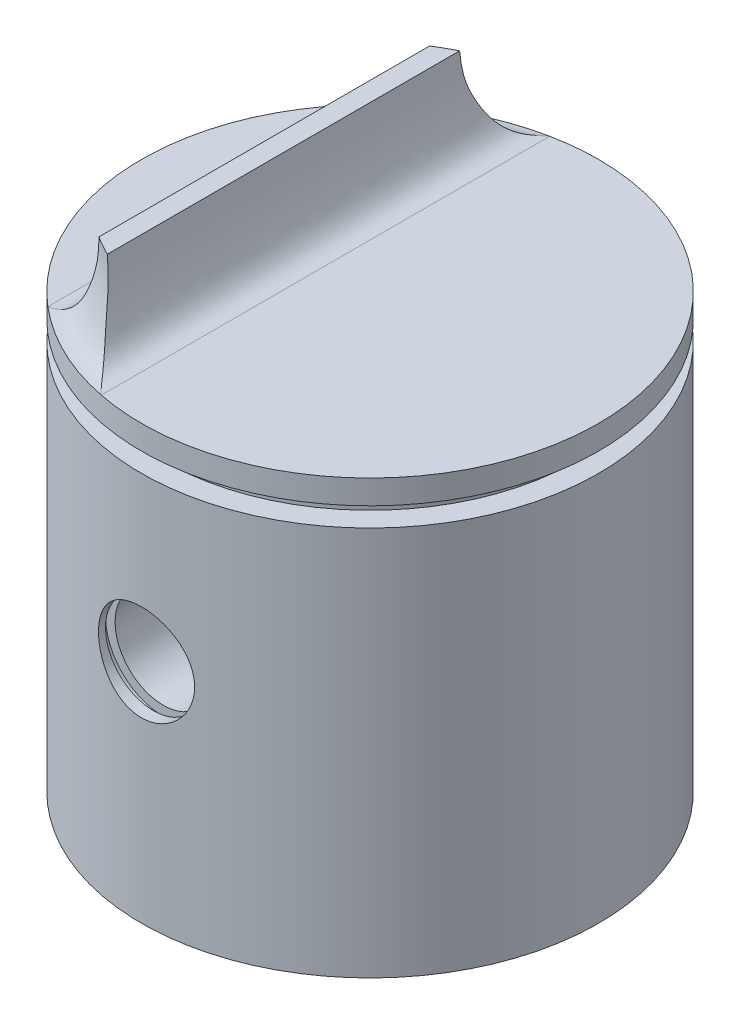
ISO-10303-21;
HEADER;
FILE_DESCRIPTION(('STEP AP214'),'2;1');
FILE_NAME('part.step','',(''),(''),'','','');
FILE_SCHEMA(('AUTOMOTIVE_DESIGN { 1 0 10303 214 1 1 1 1 }'));
ENDSEC;
DATA;
#1=APPLICATION_CONTEXT('core data for automotive mechanical design processes');
#2=APPLICATION_PROTOCOL_DEFINITION('international standard','automotive_design',2000,#1);
#3=PRODUCT_CONTEXT('',#1,'mechanical');
#4=PRODUCT('Part','Part','',(#3));
#5=PRODUCT_RELATED_PRODUCT_CATEGORY('part','',(#4));
#6=PRODUCT_DEFINITION_FORMATION('','',#4);
#7=PRODUCT_DEFINITION_CONTEXT('part definition',#1,'design');
#8=PRODUCT_DEFINITION('design','',#6,#7);
#9=PRODUCT_DEFINITION_SHAPE('','',#8);
#10=(LENGTH_UNIT() NAMED_UNIT(*) SI_UNIT(.MILLI.,.METRE.));
#11=(NAMED_UNIT(*) PLANE_ANGLE_UNIT() SI_UNIT($,.RADIAN.));
#12=(NAMED_UNIT(*) SI_UNIT($,.STERADIAN.) SOLID_ANGLE_UNIT());
#13=UNCERTAINTY_MEASURE_WITH_UNIT(LENGTH_MEASURE(1.E-05),#10,'distance_accuracy_value','');
#14=(GEOMETRIC_REPRESENTATION_CONTEXT(3) GLOBAL_UNCERTAINTY_ASSIGNED_CONTEXT((#13)) GLOBAL_UNIT_ASSIGNED_CONTEXT((#10,
#11,#12)) REPRESENTATION_CONTEXT('',''));
#15=CARTESIAN_POINT('',(0.,0.,0.));
#16=DIRECTION('',(0.,0.,1.));
#17=DIRECTION('',(1.,0.,0.));
#18=AXIS2_PLACEMENT_3D('',#15,#16,#17);
#19=CARTESIAN_POINT('',(0.,20.75,0.));
#20=DIRECTION('',(0.,-1.,0.));
#21=DIRECTION('',(0.,0.,-1.));
#22=AXIS2_PLACEMENT_3D('',#19,#20,#21);
#23=PLANE('',#22);
#24=DIRECTION('',(1.,0.,0.));
#25=VECTOR('',#24,1.);
#26=CARTESIAN_POINT('',(0.,20.75,4.5));
#27=LINE('',#26,#25);
#28=CARTESIAN_POINT('',(6.,20.75,4.5));
#29=VERTEX_POINT('',#28);
#30=CARTESIAN_POINT('',(-6.,20.75,4.5));
#31=VERTEX_POINT('',#30);
#32=EDGE_CURVE('E526',#29,#31,#27,.F.);
#33=ORIENTED_EDGE('',*,*,#32,.T.);
#34=CARTESIAN_POINT('',(0.,20.75,0.));
#35=DIRECTION('',(0.,-1.,0.));
#36=DIRECTION('',(0.,0.,-1.));
#37=AXIS2_PLACEMENT_3D('',#34,#35,#36);
#38=CIRCLE('',#37,7.5);
#39=CARTESIAN_POINT('',(-6.,20.75,-4.5));
#40=VERTEX_POINT('',#39);
#41=EDGE_CURVE('E509',#31,#40,#38,.T.);
#42=ORIENTED_EDGE('',*,*,#41,.T.);
#43=DIRECTION('',(-1.,0.,0.));
#44=VECTOR('',#43,1.);
#45=CARTESIAN_POINT('',(0.,20.75,-4.5));
#46=LINE('',#45,#44);
#47=CARTESIAN_POINT('',(6.,20.75,-4.5));
#48=VERTEX_POINT('',#47);
#49=EDGE_CURVE('E514',#40,#48,#46,.F.);
#50=ORIENTED_EDGE('',*,*,#49,.T.);
#51=CARTESIAN_POINT('',(0.,20.75,0.));
#52=DIRECTION('',(0.,-1.,0.));
#53=DIRECTION('',(0.,0.,-1.));
#54=AXIS2_PLACEMENT_3D('',#51,#52,#53);
#55=CIRCLE('',#54,7.5);
#56=EDGE_CURVE('E521',#48,#29,#55,.T.);
#57=ORIENTED_EDGE('',*,*,#56,.T.);
#58=EDGE_LOOP('',(#33,#42,#50,#57));
#59=FACE_BOUND('',#58,.T.);
#60=ADVANCED_FACE('F32',(#59),#23,.T.);
#61=CARTESIAN_POINT('',(0.,20.75,0.));
#62=DIRECTION('',(0.,-1.,0.));
#63=DIRECTION('',(0.,0.,-1.));
#64=AXIS2_PLACEMENT_3D('',#61,#62,#63);
#65=CYLINDRICAL_SURFACE('',#64,8.5);
#66=CARTESIAN_POINT('',(0.,18.5,0.));
#67=DIRECTION('',(0.,-1.,0.));
#68=DIRECTION('',(0.,0.,-1.));
#69=AXIS2_PLACEMENT_3D('',#66,#67,#68);
#70=CIRCLE('',#69,8.5);
#71=CARTESIAN_POINT('',(6.8,18.5,-5.1));
#72=VERTEX_POINT('',#71);
#73=CARTESIAN_POINT('',(6.8,18.5,5.1));
#74=VERTEX_POINT('',#73);
#75=EDGE_CURVE('E365',#72,#74,#70,.T.);
#76=ORIENTED_EDGE('',*,*,#75,.T.);
#77=DIRECTION('',(0.,-1.,0.));
#78=VECTOR('',#77,1.);
#79=CARTESIAN_POINT('',(6.8,20.75,5.1));
#80=LINE('',#79,#78);
#81=CARTESIAN_POINT('',(6.8,19.75,5.1));
#82=VERTEX_POINT('',#81);
#83=EDGE_CURVE('E464',#74,#82,#80,.F.);
#84=ORIENTED_EDGE('',*,*,#83,.T.);
#85=CARTESIAN_POINT('',(0.,19.75,0.));
#86=DIRECTION('',(0.,-1.,0.));
#87=DIRECTION('',(0.,0.,-1.));
#88=AXIS2_PLACEMENT_3D('',#85,#86,#87);
#89=CIRCLE('',#88,8.5);
#90=CARTESIAN_POINT('',(6.8,19.75,-5.1));
#91=VERTEX_POINT('',#90);
#92=EDGE_CURVE('E535',#82,#91,#89,.F.);
#93=ORIENTED_EDGE('',*,*,#92,.T.);
#94=DIRECTION('',(0.,-1.,0.));
#95=VECTOR('',#94,1.);
#96=CARTESIAN_POINT('',(6.8,20.75,-5.1));
#97=LINE('',#96,#95);
#98=EDGE_CURVE('E462',#91,#72,#97,.T.);
#99=ORIENTED_EDGE('',*,*,#98,.T.);
#100=EDGE_LOOP('',(#76,#84,#93,#99));
#101=FACE_BOUND('',#100,.T.);
#102=ADVANCED_FACE('F684',(#101),#65,.F.);
#103=CARTESIAN_POINT('',(0.,19.75,0.));
#104=DIRECTION('',(0.,-1.,0.));
#105=DIRECTION('',(0.,0.,-1.));
#106=AXIS2_PLACEMENT_3D('',#103,#104,#105);
#107=CIRCLE('',#106,8.5);
#108=CARTESIAN_POINT('',(-6.8,19.75,-5.1));
#109=VERTEX_POINT('',#108);
#110=CARTESIAN_POINT('',(-6.8,19.75,5.1));
#111=VERTEX_POINT('',#110);
#112=EDGE_CURVE('E511',#109,#111,#107,.F.);
#113=ORIENTED_EDGE('',*,*,#112,.T.);
#114=DIRECTION('',(0.,-1.,0.));
#115=VECTOR('',#114,1.);
#116=CARTESIAN_POINT('',(-6.8,20.75,5.1));
#117=LINE('',#116,#115);
#118=CARTESIAN_POINT('',(-6.8,18.5,5.1));
#119=VERTEX_POINT('',#118);
#120=EDGE_CURVE('E472',#111,#119,#117,.T.);
#121=ORIENTED_EDGE('',*,*,#120,.T.);
#122=CARTESIAN_POINT('',(-6.8,18.5,-5.1));
#123=VERTEX_POINT('',#122);
#124=EDGE_CURVE('E362',#119,#123,#70,.T.);
#125=ORIENTED_EDGE('',*,*,#124,.T.);
#126=DIRECTION('',(0.,-1.,0.));
#127=VECTOR('',#126,1.);
#128=CARTESIAN_POINT('',(-6.8,20.75,-5.1));
#129=LINE('',#128,#127);
#130=EDGE_CURVE('E470',#123,#109,#129,.F.);
#131=ORIENTED_EDGE('',*,*,#130,.T.);
#132=EDGE_LOOP('',(#113,#121,#125,#131));
#133=FACE_BOUND('',#132,.T.);
#134=ADVANCED_FACE('F491',(#133),#65,.F.);
#135=CARTESIAN_POINT('',(0.,18.5,0.));
#136=DIRECTION('',(0.,-1.,0.));
#137=DIRECTION('',(0.,0.,-1.));
#138=AXIS2_PLACEMENT_3D('',#135,#136,#137);
#139=CYLINDRICAL_SURFACE('',#138,9.75);
#140=CARTESIAN_POINT('',(0.,6.75,0.));
#141=DIRECTION('',(0.,-1.,0.));
#142=DIRECTION('',(0.,0.,-1.));
#143=AXIS2_PLACEMENT_3D('',#140,#141,#142);
#144=CIRCLE('',#143,9.75);
#145=CARTESIAN_POINT('',(-6.40714285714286,6.75,7.34921903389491));
#146=VERTEX_POINT('',#145);
#147=CARTESIAN_POINT('',(-6.40714285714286,6.75,-7.34921903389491));
#148=VERTEX_POINT('',#147);
#149=EDGE_CURVE('E261',#146,#148,#144,.T.);
#150=ORIENTED_EDGE('',*,*,#149,.T.);
#151=DIRECTION('',(0.,-1.,0.));
#152=VECTOR('',#151,1.);
#153=CARTESIAN_POINT('',(-6.40714285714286,18.5,-7.34921903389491));
#154=LINE('',#153,#152);
#155=CARTESIAN_POINT('',(-6.40714285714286,17.5,-7.34921903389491));
#156=VERTEX_POINT('',#155);
#157=EDGE_CURVE('E436',#148,#156,#154,.F.);
#158=ORIENTED_EDGE('',*,*,#157,.T.);
#159=CARTESIAN_POINT('',(0.,17.5,0.));
#160=DIRECTION('',(0.,-1.,0.));
#161=DIRECTION('',(0.,0.,-1.));
#162=AXIS2_PLACEMENT_3D('',#159,#160,#161);
#163=CIRCLE('',#162,9.75);
#164=CARTESIAN_POINT('',(-6.40714285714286,17.5,7.34921903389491));
#165=VERTEX_POINT('',#164);
#166=EDGE_CURVE('E542',#156,#165,#163,.F.);
#167=ORIENTED_EDGE('',*,*,#166,.T.);
#168=DIRECTION('',(0.,-1.,0.));
#169=VECTOR('',#168,1.);
#170=CARTESIAN_POINT('',(-6.40714285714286,18.5,7.34921903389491));
#171=LINE('',#170,#169);
#172=EDGE_CURVE('E571',#165,#146,#171,.T.);
#173=ORIENTED_EDGE('',*,*,#172,.T.);
#174=EDGE_LOOP('',(#150,#158,#167,#173));
#175=FACE_BOUND('',#174,.T.);
#176=ADVANCED_FACE('F696',(#175),#139,.F.);
#177=CARTESIAN_POINT('',(0.,17.5,0.));
#178=DIRECTION('',(0.,-1.,0.));
#179=DIRECTION('',(0.,0.,-1.));
#180=AXIS2_PLACEMENT_3D('',#177,#178,#179);
#181=CIRCLE('',#180,9.75);
#182=CARTESIAN_POINT('',(6.40714285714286,17.5,7.34921903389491));
#183=VERTEX_POINT('',#182);
#184=CARTESIAN_POINT('',(6.40714285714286,17.5,-7.34921903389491));
#185=VERTEX_POINT('',#184);
#186=EDGE_CURVE('E546',#183,#185,#181,.F.);
#187=ORIENTED_EDGE('',*,*,#186,.T.);
#188=DIRECTION('',(0.,-1.,0.));
#189=VECTOR('',#188,1.);
#190=CARTESIAN_POINT('',(6.40714285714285,18.5,-7.34921903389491));
#191=LINE('',#190,#189);
#192=CARTESIAN_POINT('',(6.40714285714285,6.75,-7.34921903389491));
#193=VERTEX_POINT('',#192);
#194=EDGE_CURVE('E417',#185,#193,#191,.T.);
#195=ORIENTED_EDGE('',*,*,#194,.T.);
#196=CARTESIAN_POINT('',(6.40714285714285,6.75,7.34921903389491));
#197=VERTEX_POINT('',#196);
#198=EDGE_CURVE('E361',#193,#197,#144,.T.);
#199=ORIENTED_EDGE('',*,*,#198,.T.);
#200=DIRECTION('',(0.,-1.,0.));
#201=VECTOR('',#200,1.);
#202=CARTESIAN_POINT('',(6.40714285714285,18.5,7.34921903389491));
#203=LINE('',#202,#201);
#204=EDGE_CURVE('E549',#197,#183,#203,.F.);
#205=ORIENTED_EDGE('',*,*,#204,.T.);
#206=EDGE_LOOP('',(#187,#195,#199,#205));
#207=FACE_BOUND('',#206,.T.);
#208=ADVANCED_FACE('F698',(#207),#139,.F.);
#209=CARTESIAN_POINT('',(0.,18.5,0.));
#210=DIRECTION('',(0.,-1.,0.));
#211=DIRECTION('',(0.,0.,-1.));
#212=AXIS2_PLACEMENT_3D('',#209,#210,#211);
#213=PLANE('',#212);
#214=CARTESIAN_POINT('',(0.,18.5,0.));
#215=DIRECTION('',(0.,-1.,0.));
#216=DIRECTION('',(0.,0.,-1.));
#217=AXIS2_PLACEMENT_3D('',#214,#215,#216);
#218=CIRCLE('',#217,8.75);
#219=CARTESIAN_POINT('',(-5.75,18.5,6.59545297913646));
#220=VERTEX_POINT('',#219);
#221=CARTESIAN_POINT('',(-5.75,18.5,-6.59545297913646));
#222=VERTEX_POINT('',#221);
#223=EDGE_CURVE('E540',#220,#222,#218,.T.);
#224=ORIENTED_EDGE('',*,*,#223,.T.);
#225=DIRECTION('',(0.,0.,1.));
#226=VECTOR('',#225,1.);
#227=CARTESIAN_POINT('',(-5.75,18.5,0.));
#228=LINE('',#227,#226);
#229=CARTESIAN_POINT('',(-5.75,18.5,-5.5));
#230=VERTEX_POINT('',#229);
#231=EDGE_CURVE('E427',#222,#230,#228,.T.);
#232=ORIENTED_EDGE('',*,*,#231,.T.);
#233=DIRECTION('',(-1.,0.,0.));
#234=VECTOR('',#233,1.);
#235=CARTESIAN_POINT('',(-6.48074069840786,18.5,-5.5));
#236=LINE('',#235,#234);
#237=CARTESIAN_POINT('',(-6.,18.5,-5.5));
#238=VERTEX_POINT('',#237);
#239=EDGE_CURVE('E486',#230,#238,#236,.T.);
#240=ORIENTED_EDGE('',*,*,#239,.T.);
#241=CARTESIAN_POINT('',(-6.,18.5,-4.5));
#242=DIRECTION('',(0.,-1.,0.));
#243=DIRECTION('',(0.,0.,-1.));
#244=AXIS2_PLACEMENT_3D('',#241,#242,#243);
#245=CIRCLE('',#244,1.);
#246=EDGE_CURVE('E41',#238,#123,#245,.F.);
#247=ORIENTED_EDGE('',*,*,#246,.T.);
#248=ORIENTED_EDGE('',*,*,#124,.F.);
#249=CARTESIAN_POINT('',(-6.,18.5,4.5));
#250=DIRECTION('',(0.,-1.,0.));
#251=DIRECTION('',(0.,0.,-1.));
#252=AXIS2_PLACEMENT_3D('',#249,#250,#251);
#253=CIRCLE('',#252,1.);
#254=CARTESIAN_POINT('',(-6.,18.5,5.5));
#255=VERTEX_POINT('',#254);
#256=EDGE_CURVE('E479',#119,#255,#253,.F.);
#257=ORIENTED_EDGE('',*,*,#256,.T.);
#258=DIRECTION('',(1.,0.,0.));
#259=VECTOR('',#258,1.);
#260=CARTESIAN_POINT('',(-4.75,18.5,5.5));
#261=LINE('',#260,#259);
#262=CARTESIAN_POINT('',(-5.75,18.5,5.5));
#263=VERTEX_POINT('',#262);
#264=EDGE_CURVE('E614',#255,#263,#261,.T.);
#265=ORIENTED_EDGE('',*,*,#264,.T.);
#266=DIRECTION('',(0.,0.,1.));
#267=VECTOR('',#266,1.);
#268=CARTESIAN_POINT('',(-5.75,18.5,0.));
#269=LINE('',#268,#267);
#270=EDGE_CURVE('E576',#263,#220,#269,.T.);
#271=ORIENTED_EDGE('',*,*,#270,.T.);
#272=EDGE_LOOP('',(#224,#232,#240,#247,#248,#257,#265,#271));
#273=FACE_BOUND('',#272,.T.);
#274=ADVANCED_FACE('F484',(#273),#213,.T.);
#275=ORIENTED_EDGE('',*,*,#75,.F.);
#276=CARTESIAN_POINT('',(6.,18.5,-4.5));
#277=DIRECTION('',(0.,-1.,0.));
#278=DIRECTION('',(0.,0.,-1.));
#279=AXIS2_PLACEMENT_3D('',#276,#277,#278);
#280=CIRCLE('',#279,1.);
#281=CARTESIAN_POINT('',(6.,18.5,-5.5));
#282=VERTEX_POINT('',#281);
#283=EDGE_CURVE('E11',#72,#282,#280,.F.);
#284=ORIENTED_EDGE('',*,*,#283,.T.);
#285=DIRECTION('',(-1.,0.,0.));
#286=VECTOR('',#285,1.);
#287=CARTESIAN_POINT('',(4.75,18.5,-5.5));
#288=LINE('',#287,#286);
#289=CARTESIAN_POINT('',(5.75,18.5,-5.5));
#290=VERTEX_POINT('',#289);
#291=EDGE_CURVE('E586',#282,#290,#288,.T.);
#292=ORIENTED_EDGE('',*,*,#291,.T.);
#293=DIRECTION('',(0.,0.,-1.));
#294=VECTOR('',#293,1.);
#295=CARTESIAN_POINT('',(5.75,18.5,0.));
#296=LINE('',#295,#294);
#297=CARTESIAN_POINT('',(5.75,18.5,-6.59545297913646));
#298=VERTEX_POINT('',#297);
#299=EDGE_CURVE('E419',#290,#298,#296,.T.);
#300=ORIENTED_EDGE('',*,*,#299,.T.);
#301=CARTESIAN_POINT('',(0.,18.5,0.));
#302=DIRECTION('',(0.,-1.,0.));
#303=DIRECTION('',(0.,0.,-1.));
#304=AXIS2_PLACEMENT_3D('',#301,#302,#303);
#305=CIRCLE('',#304,8.75);
#306=CARTESIAN_POINT('',(5.75,18.5,6.59545297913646));
#307=VERTEX_POINT('',#306);
#308=EDGE_CURVE('E544',#298,#307,#305,.T.);
#309=ORIENTED_EDGE('',*,*,#308,.T.);
#310=DIRECTION('',(0.,0.,-1.));
#311=VECTOR('',#310,1.);
#312=CARTESIAN_POINT('',(5.75,18.5,0.));
#313=LINE('',#312,#311);
#314=CARTESIAN_POINT('',(5.75,18.5,5.5));
#315=VERTEX_POINT('',#314);
#316=EDGE_CURVE('E559',#307,#315,#313,.T.);
#317=ORIENTED_EDGE('',*,*,#316,.T.);
#318=DIRECTION('',(1.,0.,0.));
#319=VECTOR('',#318,1.);
#320=CARTESIAN_POINT('',(6.48074069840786,18.5,5.5));
#321=LINE('',#320,#319);
#322=CARTESIAN_POINT('',(6.,18.5,5.5));
#323=VERTEX_POINT('',#322);
#324=EDGE_CURVE('E616',#315,#323,#321,.T.);
#325=ORIENTED_EDGE('',*,*,#324,.T.);
#326=CARTESIAN_POINT('',(6.,18.5,4.5));
#327=DIRECTION('',(0.,-1.,0.));
#328=DIRECTION('',(0.,0.,-1.));
#329=AXIS2_PLACEMENT_3D('',#326,#327,#328);
#330=CIRCLE('',#329,1.);
#331=EDGE_CURVE('E477',#323,#74,#330,.F.);
#332=ORIENTED_EDGE('',*,*,#331,.T.);
#333=EDGE_LOOP('',(#275,#284,#292,#300,#309,#317,#325,#332));
#334=FACE_BOUND('',#333,.T.);
#335=ADVANCED_FACE('F585',(#334),#213,.T.);
#336=CARTESIAN_POINT('',(-11.88,22.5,0.));
#337=DIRECTION('',(0.,-1.,0.));
#338=DIRECTION('',(0.,0.,-1.));
#339=AXIS2_PLACEMENT_3D('',#336,#337,#338);
#340=PLANE('',#339);
#341=DIRECTION('',(0.,0.,-1.));
#342=VECTOR('',#341,1.);
#343=CARTESIAN_POINT('',(-2.315,22.5,11.881));
#344=LINE('',#343,#342);
#345=CARTESIAN_POINT('',(-2.315,22.5,11.6522605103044));
#346=VERTEX_POINT('',#345);
#347=CARTESIAN_POINT('',(-2.315,22.5,-11.6522605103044));
#348=VERTEX_POINT('',#347);
#349=EDGE_CURVE('E257',#346,#348,#344,.T.);
#350=ORIENTED_EDGE('',*,*,#349,.F.);
#351=CARTESIAN_POINT('',(0.,22.5,0.));
#352=DIRECTION('',(0.,-1.,0.));
#353=DIRECTION('',(0.,0.,-1.));
#354=AXIS2_PLACEMENT_3D('',#351,#352,#353);
#355=CIRCLE('',#354,11.88);
#356=EDGE_CURVE('E276',#348,#346,#355,.T.);
#357=ORIENTED_EDGE('',*,*,#356,.F.);
#358=EDGE_LOOP('',(#350,#357));
#359=FACE_BOUND('',#358,.T.);
#360=ADVANCED_FACE('F909',(#359),#340,.F.);
#361=DIRECTION('',(0.,0.,-1.));
#362=VECTOR('',#361,1.);
#363=CARTESIAN_POINT('',(-7.685,22.5,11.881));
#364=LINE('',#363,#362);
#365=CARTESIAN_POINT('',(-7.685,22.5,9.05953503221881));
#366=VERTEX_POINT('',#365);
#367=CARTESIAN_POINT('',(-7.685,22.5,-9.05953503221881));
#368=VERTEX_POINT('',#367);
#369=EDGE_CURVE('E259',#366,#368,#364,.T.);
#370=ORIENTED_EDGE('',*,*,#369,.T.);
#371=EDGE_CURVE('E279',#366,#368,#355,.T.);
#372=ORIENTED_EDGE('',*,*,#371,.F.);
#373=EDGE_LOOP('',(#370,#372));
#374=FACE_BOUND('',#373,.T.);
#375=ADVANCED_FACE('F878',(#374),#340,.F.);
#376=CARTESIAN_POINT('',(0.,0.,0.));
#377=DIRECTION('',(0.,-1.,0.));
#378=DIRECTION('',(0.,0.,-1.));
#379=AXIS2_PLACEMENT_3D('',#376,#377,#378);
#380=CYLINDRICAL_SURFACE('',#379,11.88);
#381=CARTESIAN_POINT('',(0.,14.2500000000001,11.88));
#382=CARTESIAN_POINT('',(0.138785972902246,14.2499950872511,11.8799974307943));
#383=CARTESIAN_POINT('',(0.277632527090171,14.2384040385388,11.8775431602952));
#384=CARTESIAN_POINT('',(0.551390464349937,14.1923890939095,11.8679894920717));
#385=CARTESIAN_POINT('',(0.686298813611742,14.1579480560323,11.8608866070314));
#386=CARTESIAN_POINT('',(0.948183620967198,14.0673526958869,11.8428275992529));
#387=CARTESIAN_POINT('',(1.07516790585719,14.0112202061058,11.8318753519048));
#388=CARTESIAN_POINT('',(1.31790986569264,13.8789026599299,11.8073035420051));
#389=CARTESIAN_POINT('',(1.43366800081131,13.8027184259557,11.7936840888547));
#390=CARTESIAN_POINT('',(1.65240472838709,13.6312564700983,11.765045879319));
#391=CARTESIAN_POINT('',(1.75519183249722,13.5357371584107,11.7500108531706));
#392=CARTESIAN_POINT('',(1.94340940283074,13.3288354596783,11.7203523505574));
#393=CARTESIAN_POINT('',(2.02883841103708,13.2174517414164,11.705728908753));
#394=CARTESIAN_POINT('',(2.18074613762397,12.9805845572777,11.6783896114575));
#395=CARTESIAN_POINT('',(2.24702352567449,12.8549693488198,11.6656946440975));
#396=CARTESIAN_POINT('',(2.35745595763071,12.5940736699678,11.6438821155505));
#397=CARTESIAN_POINT('',(2.40161343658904,12.4587942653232,11.634764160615));
#398=CARTESIAN_POINT('',(2.46592478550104,12.1844799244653,11.6213032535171));
#399=CARTESIAN_POINT('',(2.48641632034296,12.0455275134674,11.6168931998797));
#400=CARTESIAN_POINT('',(2.50386353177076,11.7660924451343,11.613145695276));
#401=CARTESIAN_POINT('',(2.50082187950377,11.6256099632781,11.6138076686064));
#402=CARTESIAN_POINT('',(2.47156136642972,11.349594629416,11.6200685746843));
#403=CARTESIAN_POINT('',(2.4457324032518,11.2140182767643,11.6255844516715));
#404=CARTESIAN_POINT('',(2.37224714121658,10.9491671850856,11.640800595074));
#405=CARTESIAN_POINT('',(2.32458969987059,10.8198927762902,11.6505010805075));
#406=CARTESIAN_POINT('',(2.20843584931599,10.5702066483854,11.6730766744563));
#407=CARTESIAN_POINT('',(2.13978743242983,10.4498678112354,11.6859748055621));
#408=CARTESIAN_POINT('',(1.98370735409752,10.2222724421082,11.7134779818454));
#409=CARTESIAN_POINT('',(1.89627331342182,10.1150175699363,11.7280832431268));
#410=CARTESIAN_POINT('',(1.70302927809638,9.91438762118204,11.7577129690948));
#411=CARTESIAN_POINT('',(1.59688717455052,9.82133250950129,11.7727399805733));
#412=CARTESIAN_POINT('',(1.37033695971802,9.6542941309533,11.8012537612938));
#413=CARTESIAN_POINT('',(1.24992862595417,9.58031116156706,11.8147405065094));
#414=CARTESIAN_POINT('',(0.997889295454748,9.45344716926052,11.83869295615));
#415=CARTESIAN_POINT('',(0.866237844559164,9.4006056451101,11.8491529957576));
#416=CARTESIAN_POINT('',(0.595656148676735,9.3178814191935,11.8658310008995));
#417=CARTESIAN_POINT('',(0.456726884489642,9.28799563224,11.8720495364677));
#418=CARTESIAN_POINT('',(0.178280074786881,9.25249099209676,11.8794635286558));
#419=CARTESIAN_POINT('',(0.0388206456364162,9.24643470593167,11.8807495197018));
#420=CARTESIAN_POINT('',(-0.239117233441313,9.25757877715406,11.8784062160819));
#421=CARTESIAN_POINT('',(-0.377595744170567,9.27477768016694,11.8747772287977));
#422=CARTESIAN_POINT('',(-0.648208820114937,9.33158084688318,11.8630686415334));
#423=CARTESIAN_POINT('',(-0.780393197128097,9.3709579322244,11.8550341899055));
#424=CARTESIAN_POINT('',(-1.03628194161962,9.47074930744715,11.835413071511));
#425=CARTESIAN_POINT('',(-1.15998562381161,9.53116529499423,11.8238261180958));
#426=CARTESIAN_POINT('',(-1.39722665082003,9.67224666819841,11.7981608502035));
#427=CARTESIAN_POINT('',(-1.51060600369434,9.75317192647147,11.7840513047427));
#428=CARTESIAN_POINT('',(-1.72233261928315,9.93262987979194,11.7549739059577));
#429=CARTESIAN_POINT('',(-1.82067808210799,10.0311646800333,11.7400059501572));
#430=CARTESIAN_POINT('',(-2.00125614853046,10.2450449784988,11.7105893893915));
#431=CARTESIAN_POINT('',(-2.08318699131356,10.3606473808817,11.6961539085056));
#432=CARTESIAN_POINT('',(-2.22647077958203,10.6042293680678,11.6697282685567));
#433=CARTESIAN_POINT('',(-2.28782458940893,10.7322084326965,11.6577380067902));
#434=CARTESIAN_POINT('',(-2.38781501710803,10.9962400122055,11.6376691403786));
#435=CARTESIAN_POINT('',(-2.42657538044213,11.132243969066,11.6295692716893));
#436=CARTESIAN_POINT('',(-2.48064737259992,11.4090251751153,11.6181567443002));
#437=CARTESIAN_POINT('',(-2.49596243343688,11.5498017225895,11.6148433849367));
#438=CARTESIAN_POINT('',(-2.5025715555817,11.82909541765,11.6134208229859));
#439=CARTESIAN_POINT('',(-2.49434330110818,11.9676009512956,11.6152081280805));
#440=CARTESIAN_POINT('',(-2.45516108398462,12.2412053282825,11.6235527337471));
#441=CARTESIAN_POINT('',(-2.42420734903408,12.3763042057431,11.6301099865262));
#442=CARTESIAN_POINT('',(-2.34067573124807,12.63891504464,11.6472070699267));
#443=CARTESIAN_POINT('',(-2.28816242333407,12.7664483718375,11.6577350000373));
#444=CARTESIAN_POINT('',(-2.1630597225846,13.0109671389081,11.6815927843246));
#445=CARTESIAN_POINT('',(-2.09046842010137,13.1279515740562,11.6949229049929));
#446=CARTESIAN_POINT('',(-1.92566459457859,13.3504174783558,11.7231956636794));
#447=CARTESIAN_POINT('',(-1.83310955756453,13.4556420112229,11.738163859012));
#448=CARTESIAN_POINT('',(-1.63170573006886,13.6492234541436,11.7678493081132));
#449=CARTESIAN_POINT('',(-1.52285319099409,13.7375764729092,11.7825665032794));
#450=CARTESIAN_POINT('',(-1.29039621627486,13.8959003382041,11.8102974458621));
#451=CARTESIAN_POINT('',(-1.1666326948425,13.9656416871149,11.8232890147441));
#452=CARTESIAN_POINT('',(-0.908897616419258,14.0832234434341,11.8458844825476));
#453=CARTESIAN_POINT('',(-0.774935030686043,14.1310828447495,11.8554913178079));
#454=CARTESIAN_POINT('',(-0.533967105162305,14.1946755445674,11.8684513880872));
#455=CARTESIAN_POINT('',(-0.428297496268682,14.2153838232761,11.8727559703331));
#456=CARTESIAN_POINT('',(-0.215097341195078,14.2430476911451,11.8785312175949));
#457=CARTESIAN_POINT('',(-0.107566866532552,14.2500038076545,11.8800019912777));
#458=CARTESIAN_POINT('',(0.,14.2500000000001,11.88));
#459=B_SPLINE_CURVE_WITH_KNOTS('',3,(#381,#382,#383,#384,#385,#386,#387,#388,#389,#390,#391,
#392,#393,#394,#395,#396,#397,#398,#399,#400,#401,#402,#403,#404,#405,#406,#407,#408,#409,#410,
#411,#412,#413,#414,#415,#416,#417,#418,#419,#420,#421,#422,#423,#424,#425,#426,#427,#428,#429,
#430,#431,#432,#433,#434,#435,#436,#437,#438,#439,#440,#441,#442,#443,#444,#445,#446,#447,#448,
#449,#450,#451,#452,#453,#454,#455,#456,#457,#458),.UNSPECIFIED.,.T.,.F.,(4,2,2,2,2,2,2,2,2,2,2,
2,2,2,2,2,2,2,2,2,2,2,2,2,2,2,2,2,2,2,2,2,2,2,2,2,2,2,4),(0.,0.415964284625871,
0.832240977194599,1.24809977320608,1.66394151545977,2.0853413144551,2.50677649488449,
2.93249298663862,3.35816260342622,3.77768067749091,4.19715113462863,4.60958057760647,
5.02203160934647,5.43754315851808,5.85310736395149,6.27697066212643,6.70084057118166,
7.12549874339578,7.55009983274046,7.96686920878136,8.38361252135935,8.79616266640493,
9.20874610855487,9.62684441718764,10.0449927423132,10.4702371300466,10.8954636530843,
11.3183387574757,11.7411519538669,12.1554476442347,12.569739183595,12.9827987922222,
13.3958977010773,13.8167455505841,14.2376903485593,14.6636081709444,15.0891555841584,
15.4115634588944,15.7339589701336),.UNSPECIFIED.);
#460=CARTESIAN_POINT('',(0.,14.2500000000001,11.88));
#461=VERTEX_POINT('',#460);
#462=EDGE_CURVE('E647',#461,#461,#459,.T.);
#463=ORIENTED_EDGE('',*,*,#462,.T.);
#464=EDGE_LOOP('',(#463));
#465=FACE_BOUND('',#464,.T.);
#466=CARTESIAN_POINT('',(0.,14.2500000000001,-11.88));
#467=CARTESIAN_POINT('',(-0.138785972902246,14.2499950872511,-11.8799974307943));
#468=CARTESIAN_POINT('',(-0.277632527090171,14.2384040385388,-11.8775431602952));
#469=CARTESIAN_POINT('',(-0.551390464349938,14.1923890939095,-11.8679894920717));
#470=CARTESIAN_POINT('',(-0.686298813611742,14.1579480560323,-11.8608866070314));
#471=CARTESIAN_POINT('',(-0.948183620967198,14.0673526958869,-11.8428275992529));
#472=CARTESIAN_POINT('',(-1.07516790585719,14.0112202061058,-11.8318753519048));
#473=CARTESIAN_POINT('',(-1.31790986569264,13.8789026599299,-11.8073035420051));
#474=CARTESIAN_POINT('',(-1.43366800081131,13.8027184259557,-11.7936840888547));
#475=CARTESIAN_POINT('',(-1.65240472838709,13.6312564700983,-11.765045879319));
#476=CARTESIAN_POINT('',(-1.75519183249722,13.5357371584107,-11.7500108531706));
#477=CARTESIAN_POINT('',(-1.94340940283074,13.3288354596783,-11.7203523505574));
#478=CARTESIAN_POINT('',(-2.02883841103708,13.2174517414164,-11.705728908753));
#479=CARTESIAN_POINT('',(-2.18074613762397,12.9805845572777,-11.6783896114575));
#480=CARTESIAN_POINT('',(-2.24702352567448,12.8549693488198,-11.6656946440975));
#481=CARTESIAN_POINT('',(-2.3574559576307,12.5940736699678,-11.6438821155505));
#482=CARTESIAN_POINT('',(-2.40161343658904,12.4587942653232,-11.634764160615));
#483=CARTESIAN_POINT('',(-2.46592478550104,12.1844799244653,-11.6213032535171));
#484=CARTESIAN_POINT('',(-2.48641632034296,12.0455275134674,-11.6168931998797));
#485=CARTESIAN_POINT('',(-2.50386353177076,11.7660924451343,-11.613145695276));
#486=CARTESIAN_POINT('',(-2.50082187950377,11.6256099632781,-11.6138076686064));
#487=CARTESIAN_POINT('',(-2.47156136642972,11.349594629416,-11.6200685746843));
#488=CARTESIAN_POINT('',(-2.4457324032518,11.2140182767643,-11.6255844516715));
#489=CARTESIAN_POINT('',(-2.37224714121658,10.9491671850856,-11.640800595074));
#490=CARTESIAN_POINT('',(-2.32458969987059,10.8198927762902,-11.6505010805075));
#491=CARTESIAN_POINT('',(-2.20843584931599,10.5702066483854,-11.6730766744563));
#492=CARTESIAN_POINT('',(-2.13978743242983,10.4498678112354,-11.6859748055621));
#493=CARTESIAN_POINT('',(-1.98370735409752,10.2222724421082,-11.7134779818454));
#494=CARTESIAN_POINT('',(-1.89627331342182,10.1150175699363,-11.7280832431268));
#495=CARTESIAN_POINT('',(-1.70302927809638,9.91438762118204,-11.7577129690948));
#496=CARTESIAN_POINT('',(-1.59688717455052,9.82133250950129,-11.7727399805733));
#497=CARTESIAN_POINT('',(-1.37033695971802,9.6542941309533,-11.8012537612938));
#498=CARTESIAN_POINT('',(-1.24992862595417,9.58031116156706,-11.8147405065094));
#499=CARTESIAN_POINT('',(-0.997889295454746,9.45344716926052,-11.83869295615));
#500=CARTESIAN_POINT('',(-0.866237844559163,9.40060564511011,-11.8491529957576));
#501=CARTESIAN_POINT('',(-0.595656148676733,9.3178814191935,-11.8658310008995));
#502=CARTESIAN_POINT('',(-0.456726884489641,9.28799563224,-11.8720495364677));
#503=CARTESIAN_POINT('',(-0.17828007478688,9.25249099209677,-11.8794635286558));
#504=CARTESIAN_POINT('',(-0.0388206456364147,9.24643470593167,-11.8807495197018));
#505=CARTESIAN_POINT('',(0.239117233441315,9.25757877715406,-11.8784062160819));
#506=CARTESIAN_POINT('',(0.377595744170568,9.27477768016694,-11.8747772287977));
#507=CARTESIAN_POINT('',(0.648208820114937,9.33158084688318,-11.8630686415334));
#508=CARTESIAN_POINT('',(0.780393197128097,9.37095793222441,-11.8550341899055));
#509=CARTESIAN_POINT('',(1.03628194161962,9.47074930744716,-11.835413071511));
#510=CARTESIAN_POINT('',(1.15998562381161,9.53116529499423,-11.8238261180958));
#511=CARTESIAN_POINT('',(1.39722665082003,9.67224666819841,-11.7981608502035));
#512=CARTESIAN_POINT('',(1.51060600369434,9.75317192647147,-11.7840513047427));
#513=CARTESIAN_POINT('',(1.72233261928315,9.93262987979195,-11.7549739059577));
#514=CARTESIAN_POINT('',(1.82067808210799,10.0311646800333,-11.7400059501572));
#515=CARTESIAN_POINT('',(2.00125614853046,10.2450449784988,-11.7105893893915));
#516=CARTESIAN_POINT('',(2.08318699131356,10.3606473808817,-11.6961539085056));
#517=CARTESIAN_POINT('',(2.22647077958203,10.6042293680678,-11.6697282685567));
#518=CARTESIAN_POINT('',(2.28782458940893,10.7322084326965,-11.6577380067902));
#519=CARTESIAN_POINT('',(2.38781501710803,10.9962400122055,-11.6376691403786));
#520=CARTESIAN_POINT('',(2.42657538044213,11.132243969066,-11.6295692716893));
#521=CARTESIAN_POINT('',(2.48064737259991,11.4090251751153,-11.6181567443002));
#522=CARTESIAN_POINT('',(2.49596243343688,11.5498017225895,-11.6148433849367));
#523=CARTESIAN_POINT('',(2.5025715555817,11.8290954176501,-11.6134208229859));
#524=CARTESIAN_POINT('',(2.49434330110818,11.9676009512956,-11.6152081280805));
#525=CARTESIAN_POINT('',(2.45516108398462,12.2412053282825,-11.6235527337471));
#526=CARTESIAN_POINT('',(2.42420734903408,12.3763042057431,-11.6301099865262));
#527=CARTESIAN_POINT('',(2.34067573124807,12.63891504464,-11.6472070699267));
#528=CARTESIAN_POINT('',(2.28816242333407,12.7664483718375,-11.6577350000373));
#529=CARTESIAN_POINT('',(2.1630597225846,13.0109671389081,-11.6815927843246));
#530=CARTESIAN_POINT('',(2.09046842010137,13.1279515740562,-11.6949229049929));
#531=CARTESIAN_POINT('',(1.92566459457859,13.3504174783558,-11.7231956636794));
#532=CARTESIAN_POINT('',(1.83310955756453,13.4556420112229,-11.738163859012));
#533=CARTESIAN_POINT('',(1.63170573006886,13.6492234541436,-11.7678493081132));
#534=CARTESIAN_POINT('',(1.52285319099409,13.7375764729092,-11.7825665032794));
#535=CARTESIAN_POINT('',(1.29039621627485,13.8959003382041,-11.8102974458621));
#536=CARTESIAN_POINT('',(1.16663269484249,13.9656416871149,-11.8232890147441));
#537=CARTESIAN_POINT('',(0.908897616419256,14.0832234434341,-11.8458844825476));
#538=CARTESIAN_POINT('',(0.774935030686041,14.1310828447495,-11.8554913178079));
#539=CARTESIAN_POINT('',(0.533967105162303,14.1946755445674,-11.8684513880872));
#540=CARTESIAN_POINT('',(0.42829749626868,14.2153838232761,-11.8727559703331));
#541=CARTESIAN_POINT('',(0.215097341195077,14.2430476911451,-11.8785312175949));
#542=CARTESIAN_POINT('',(0.107566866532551,14.2500038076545,-11.8800019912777));
#543=CARTESIAN_POINT('',(0.,14.2500000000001,-11.88));
#544=B_SPLINE_CURVE_WITH_KNOTS('',3,(#466,#467,#468,#469,#470,#471,#472,#473,#474,#475,#476,
#477,#478,#479,#480,#481,#482,#483,#484,#485,#486,#487,#488,#489,#490,#491,#492,#493,#494,#495,
#496,#497,#498,#499,#500,#501,#502,#503,#504,#505,#506,#507,#508,#509,#510,#511,#512,#513,#514,
#515,#516,#517,#518,#519,#520,#521,#522,#523,#524,#525,#526,#527,#528,#529,#530,#531,#532,#533,
#534,#535,#536,#537,#538,#539,#540,#541,#542,#543),.UNSPECIFIED.,.T.,.F.,(4,2,2,2,2,2,2,2,2,2,2,
2,2,2,2,2,2,2,2,2,2,2,2,2,2,2,2,2,2,2,2,2,2,2,2,2,2,2,4),(0.,0.415964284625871,
0.832240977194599,1.24809977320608,1.66394151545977,2.0853413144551,2.50677649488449,
2.93249298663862,3.35816260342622,3.77768067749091,4.19715113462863,4.60958057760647,
5.02203160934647,5.43754315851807,5.85310736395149,6.27697066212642,6.70084057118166,
7.12549874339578,7.55009983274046,7.96686920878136,8.38361252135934,8.79616266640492,
9.20874610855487,9.62684441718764,10.0449927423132,10.4702371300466,10.8954636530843,
11.3183387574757,11.7411519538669,12.1554476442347,12.569739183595,12.9827987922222,
13.3958977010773,13.8167455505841,14.2376903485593,14.6636081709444,15.0891555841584,
15.4115634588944,15.7339589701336),.UNSPECIFIED.);
#545=CARTESIAN_POINT('',(0.,14.2500000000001,-11.88));
#546=VERTEX_POINT('',#545);
#547=EDGE_CURVE('E522',#546,#546,#544,.T.);
#548=ORIENTED_EDGE('',*,*,#547,.T.);
#549=EDGE_LOOP('',(#548));
#550=FACE_BOUND('',#549,.T.);
#551=CARTESIAN_POINT('',(0.,1.09148654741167E-13,0.));
#552=DIRECTION('',(0.,-1.,0.));
#553=DIRECTION('',(0.,0.,-1.));
#554=AXIS2_PLACEMENT_3D('',#551,#552,#553);
#555=CIRCLE('',#554,11.88);
#556=CARTESIAN_POINT('',(0.,1.09148654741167E-13,-11.88));
#557=VERTEX_POINT('',#556);
#558=EDGE_CURVE('E267',#557,#557,#555,.T.);
#559=ORIENTED_EDGE('',*,*,#558,.F.);
#560=EDGE_LOOP('',(#559));
#561=FACE_BOUND('',#560,.T.);
#562=CARTESIAN_POINT('',(0.,20.25,0.));
#563=DIRECTION('',(0.,-1.,0.));
#564=DIRECTION('',(0.,0.,-1.));
#565=AXIS2_PLACEMENT_3D('',#562,#563,#564);
#566=CIRCLE('',#565,11.88);
#567=CARTESIAN_POINT('',(0.,20.25,-11.88));
#568=VERTEX_POINT('',#567);
#569=EDGE_CURVE('E289',#568,#568,#566,.T.);
#570=ORIENTED_EDGE('',*,*,#569,.T.);
#571=EDGE_LOOP('',(#570));
#572=FACE_BOUND('',#571,.T.);
#573=ADVANCED_FACE('F34',(#465,#550,#561,#572),#380,.T.);
#574=CARTESIAN_POINT('',(-11.88,20.25,0.));
#575=DIRECTION('',(0.,-1.,0.));
#576=DIRECTION('',(0.,0.,-1.));
#577=AXIS2_PLACEMENT_3D('',#574,#575,#576);
#578=PLANE('',#577);
#579=ORIENTED_EDGE('',*,*,#569,.F.);
#580=EDGE_LOOP('',(#579));
#581=FACE_BOUND('',#580,.T.);
#582=CARTESIAN_POINT('',(0.,20.25,0.));
#583=DIRECTION('',(0.,-1.,0.));
#584=DIRECTION('',(0.,0.,-1.));
#585=AXIS2_PLACEMENT_3D('',#582,#583,#584);
#586=CIRCLE('',#585,10.75);
#587=CARTESIAN_POINT('',(0.,20.25,-10.75));
#588=VERTEX_POINT('',#587);
#589=EDGE_CURVE('E286',#588,#588,#586,.T.);
#590=ORIENTED_EDGE('',*,*,#589,.T.);
#591=EDGE_LOOP('',(#590));
#592=FACE_BOUND('',#591,.T.);
#593=ADVANCED_FACE('F877',(#581,#592),#578,.F.);
#594=CARTESIAN_POINT('',(0.,0.,0.));
#595=DIRECTION('',(0.,-1.,0.));
#596=DIRECTION('',(0.,0.,-1.));
#597=AXIS2_PLACEMENT_3D('',#594,#595,#596);
#598=CYLINDRICAL_SURFACE('',#597,10.75);
#599=ORIENTED_EDGE('',*,*,#589,.F.);
#600=EDGE_LOOP('',(#599));
#601=FACE_BOUND('',#600,.T.);
#602=CARTESIAN_POINT('',(0.,21.25,0.));
#603=DIRECTION('',(0.,-1.,0.));
#604=DIRECTION('',(0.,0.,-1.));
#605=AXIS2_PLACEMENT_3D('',#602,#603,#604);
#606=CIRCLE('',#605,10.75);
#607=CARTESIAN_POINT('',(0.,21.25,-10.75));
#608=VERTEX_POINT('',#607);
#609=EDGE_CURVE('E283',#608,#608,#606,.T.);
#610=ORIENTED_EDGE('',*,*,#609,.T.);
#611=EDGE_LOOP('',(#610));
#612=FACE_BOUND('',#611,.T.);
#613=ADVANCED_FACE('F886',(#601,#612),#598,.T.);
#614=CARTESIAN_POINT('',(-10.75,21.25,0.));
#615=DIRECTION('',(0.,1.,0.));
#616=DIRECTION('',(0.,0.,1.));
#617=AXIS2_PLACEMENT_3D('',#614,#615,#616);
#618=PLANE('',#617);
#619=ORIENTED_EDGE('',*,*,#609,.F.);
#620=EDGE_LOOP('',(#619));
#621=FACE_BOUND('',#620,.T.);
#622=CARTESIAN_POINT('',(0.,21.25,0.));
#623=DIRECTION('',(0.,-1.,0.));
#624=DIRECTION('',(0.,0.,-1.));
#625=AXIS2_PLACEMENT_3D('',#622,#623,#624);
#626=CIRCLE('',#625,11.88);
#627=CARTESIAN_POINT('',(0.,21.25,-11.88));
#628=VERTEX_POINT('',#627);
#629=EDGE_CURVE('E280',#628,#628,#626,.T.);
#630=ORIENTED_EDGE('',*,*,#629,.T.);
#631=EDGE_LOOP('',(#630));
#632=FACE_BOUND('',#631,.T.);
#633=ADVANCED_FACE('F891',(#621,#632),#618,.F.);
#634=CARTESIAN_POINT('',(0.,0.,0.));
#635=DIRECTION('',(0.,-1.,0.));
#636=DIRECTION('',(0.,0.,-1.));
#637=AXIS2_PLACEMENT_3D('',#634,#635,#636);
#638=CYLINDRICAL_SURFACE('',#637,11.88);
#639=ORIENTED_EDGE('',*,*,#629,.F.);
#640=EDGE_LOOP('',(#639));
#641=FACE_BOUND('',#640,.T.);
#642=ORIENTED_EDGE('',*,*,#356,.T.);
#643=CARTESIAN_POINT('',(0.,22.5,0.));
#644=DIRECTION('',(0.,-1.,0.));
#645=DIRECTION('',(0.,0.,-1.));
#646=AXIS2_PLACEMENT_3D('',#643,#644,#645);
#647=CIRCLE('',#646,11.88);
#648=EDGE_CURVE('E236',#346,#366,#647,.T.);
#649=ORIENTED_EDGE('',*,*,#648,.T.);
#650=ORIENTED_EDGE('',*,*,#371,.T.);
#651=EDGE_CURVE('E252',#368,#348,#647,.T.);
#652=ORIENTED_EDGE('',*,*,#651,.T.);
#653=EDGE_LOOP('',(#642,#649,#650,#652));
#654=FACE_BOUND('',#653,.T.);
#655=ADVANCED_FACE('F897',(#641,#654),#638,.T.);
#656=CARTESIAN_POINT('',(0.,6.75,0.));
#657=DIRECTION('',(0.,1.,0.));
#658=DIRECTION('',(0.,0.,1.));
#659=AXIS2_PLACEMENT_3D('',#656,#657,#658);
#660=PLANE('',#659);
#661=ORIENTED_EDGE('',*,*,#149,.F.);
#662=CARTESIAN_POINT('',(-5.75,6.75,6.59545297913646));
#663=DIRECTION('',(0.,1.,0.));
#664=DIRECTION('',(0.,0.,1.));
#665=AXIS2_PLACEMENT_3D('',#662,#663,#664);
#666=CIRCLE('',#665,1.);
#667=CARTESIAN_POINT('',(-4.75,6.75,6.59545297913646));
#668=VERTEX_POINT('',#667);
#669=EDGE_CURVE('E578',#146,#668,#666,.T.);
#670=ORIENTED_EDGE('',*,*,#669,.T.);
#671=DIRECTION('',(0.,0.,1.));
#672=VECTOR('',#671,1.);
#673=CARTESIAN_POINT('',(-4.75,6.75,8.5146931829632));
#674=LINE('',#673,#672);
#675=CARTESIAN_POINT('',(-4.75,6.75,5.5));
#676=VERTEX_POINT('',#675);
#677=EDGE_CURVE('E369',#676,#668,#674,.T.);
#678=ORIENTED_EDGE('',*,*,#677,.F.);
#679=DIRECTION('',(-1.,0.,0.));
#680=VECTOR('',#679,1.);
#681=CARTESIAN_POINT('',(-4.75,6.75,5.5));
#682=LINE('',#681,#680);
#683=CARTESIAN_POINT('',(4.75,6.75,5.5));
#684=VERTEX_POINT('',#683);
#685=EDGE_CURVE('E366',#684,#676,#682,.T.);
#686=ORIENTED_EDGE('',*,*,#685,.F.);
#687=DIRECTION('',(0.,0.,-1.));
#688=VECTOR('',#687,1.);
#689=CARTESIAN_POINT('',(4.75,6.75,8.5146931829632));
#690=LINE('',#689,#688);
#691=CARTESIAN_POINT('',(4.75,6.75,6.59545297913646));
#692=VERTEX_POINT('',#691);
#693=EDGE_CURVE('E377',#692,#684,#690,.T.);
#694=ORIENTED_EDGE('',*,*,#693,.F.);
#695=CARTESIAN_POINT('',(5.75,6.75,6.59545297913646));
#696=DIRECTION('',(0.,1.,0.));
#697=DIRECTION('',(0.,0.,1.));
#698=AXIS2_PLACEMENT_3D('',#695,#696,#697);
#699=CIRCLE('',#698,1.);
#700=EDGE_CURVE('E561',#692,#197,#699,.T.);
#701=ORIENTED_EDGE('',*,*,#700,.T.);
#702=ORIENTED_EDGE('',*,*,#198,.F.);
#703=CARTESIAN_POINT('',(5.75,6.75,-6.59545297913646));
#704=DIRECTION('',(0.,1.,0.));
#705=DIRECTION('',(0.,0.,1.));
#706=AXIS2_PLACEMENT_3D('',#703,#704,#705);
#707=CIRCLE('',#706,1.);
#708=CARTESIAN_POINT('',(4.75,6.75,-6.59545297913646));
#709=VERTEX_POINT('',#708);
#710=EDGE_CURVE('E405',#193,#709,#707,.T.);
#711=ORIENTED_EDGE('',*,*,#710,.T.);
#712=DIRECTION('',(0.,0.,-1.));
#713=VECTOR('',#712,1.);
#714=CARTESIAN_POINT('',(4.75,6.75,-8.5146931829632));
#715=LINE('',#714,#713);
#716=CARTESIAN_POINT('',(4.75,6.75,-5.5));
#717=VERTEX_POINT('',#716);
#718=EDGE_CURVE('E376',#717,#709,#715,.T.);
#719=ORIENTED_EDGE('',*,*,#718,.F.);
#720=DIRECTION('',(1.,0.,0.));
#721=VECTOR('',#720,1.);
#722=CARTESIAN_POINT('',(-4.75,6.75,-5.5));
#723=LINE('',#722,#721);
#724=CARTESIAN_POINT('',(-4.75,6.75,-5.5));
#725=VERTEX_POINT('',#724);
#726=EDGE_CURVE('E383',#725,#717,#723,.T.);
#727=ORIENTED_EDGE('',*,*,#726,.F.);
#728=DIRECTION('',(0.,0.,1.));
#729=VECTOR('',#728,1.);
#730=CARTESIAN_POINT('',(-4.75,6.75,-8.5146931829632));
#731=LINE('',#730,#729);
#732=CARTESIAN_POINT('',(-4.75,6.75,-6.59545297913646));
#733=VERTEX_POINT('',#732);
#734=EDGE_CURVE('E381',#733,#725,#731,.T.);
#735=ORIENTED_EDGE('',*,*,#734,.F.);
#736=CARTESIAN_POINT('',(-5.75,6.75,-6.59545297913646));
#737=DIRECTION('',(0.,1.,0.));
#738=DIRECTION('',(0.,0.,1.));
#739=AXIS2_PLACEMENT_3D('',#736,#737,#738);
#740=CIRCLE('',#739,1.);
#741=EDGE_CURVE('E440',#733,#148,#740,.T.);
#742=ORIENTED_EDGE('',*,*,#741,.T.);
#743=EDGE_LOOP('',(#661,#670,#678,#686,#694,#701,#702,#711,#719,#727,#735,#742));
#744=FACE_BOUND('',#743,.T.);
#745=CARTESIAN_POINT('',(0.,6.75,0.));
#746=DIRECTION('',(0.,-1.,0.));
#747=DIRECTION('',(0.,0.,-1.));
#748=AXIS2_PLACEMENT_3D('',#745,#746,#747);
#749=CIRCLE('',#748,10.5);
#750=CARTESIAN_POINT('',(0.,6.75,-10.5));
#751=VERTEX_POINT('',#750);
#752=EDGE_CURVE('E273',#751,#751,#749,.T.);
#753=ORIENTED_EDGE('',*,*,#752,.T.);
#754=EDGE_LOOP('',(#753));
#755=FACE_BOUND('',#754,.T.);
#756=ADVANCED_FACE('F400',(#744,#755),#660,.F.);
#757=CARTESIAN_POINT('',(0.,0.,0.));
#758=DIRECTION('',(0.,-1.,0.));
#759=DIRECTION('',(0.,0.,-1.));
#760=AXIS2_PLACEMENT_3D('',#757,#758,#759);
#761=CYLINDRICAL_SURFACE('',#760,10.5);
#762=ORIENTED_EDGE('',*,*,#752,.F.);
#763=EDGE_LOOP('',(#762));
#764=FACE_BOUND('',#763,.T.);
#765=CARTESIAN_POINT('',(0.,1.09736465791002E-13,0.));
#766=DIRECTION('',(0.,-1.,0.));
#767=DIRECTION('',(0.,0.,-1.));
#768=AXIS2_PLACEMENT_3D('',#765,#766,#767);
#769=CIRCLE('',#768,10.5);
#770=CARTESIAN_POINT('',(0.,1.09736465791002E-13,-10.5));
#771=VERTEX_POINT('',#770);
#772=EDGE_CURVE('E270',#771,#771,#769,.T.);
#773=ORIENTED_EDGE('',*,*,#772,.T.);
#774=EDGE_LOOP('',(#773));
#775=FACE_BOUND('',#774,.T.);
#776=ADVANCED_FACE('F920',(#764,#775),#761,.F.);
#777=CARTESIAN_POINT('',(-10.5,1.09736465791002E-13,0.));
#778=DIRECTION('',(0.,1.,0.));
#779=DIRECTION('',(0.,0.,1.));
#780=AXIS2_PLACEMENT_3D('',#777,#778,#779);
#781=PLANE('',#780);
#782=ORIENTED_EDGE('',*,*,#772,.F.);
#783=EDGE_LOOP('',(#782));
#784=FACE_BOUND('',#783,.T.);
#785=ORIENTED_EDGE('',*,*,#558,.T.);
#786=EDGE_LOOP('',(#785));
#787=FACE_BOUND('',#786,.T.);
#788=ADVANCED_FACE('F922',(#784,#787),#781,.F.);
#789=CARTESIAN_POINT('',(-5.5,26.5,11.881));
#790=DIRECTION('',(0.,-1.,0.));
#791=DIRECTION('',(0.,0.,-1.));
#792=AXIS2_PLACEMENT_3D('',#789,#790,#791);
#793=PLANE('',#792);
#794=DIRECTION('',(0.,0.,-1.));
#795=VECTOR('',#794,1.);
#796=CARTESIAN_POINT('',(-4.5,26.5,11.881));
#797=LINE('',#796,#795);
#798=CARTESIAN_POINT('',(-4.5,26.5,9.15368778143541));
#799=VERTEX_POINT('',#798);
#800=CARTESIAN_POINT('',(-4.5,26.5,-9.15368778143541));
#801=VERTEX_POINT('',#800);
#802=EDGE_CURVE('E249',#799,#801,#797,.T.);
#803=ORIENTED_EDGE('',*,*,#802,.T.);
#804=CARTESIAN_POINT('',(0.,26.5,0.));
#805=DIRECTION('',(0.,-1.,0.));
#806=DIRECTION('',(0.,0.,-1.));
#807=AXIS2_PLACEMENT_3D('',#804,#805,#806);
#808=CIRCLE('',#807,10.2);
#809=CARTESIAN_POINT('',(-5.5,26.5,-8.5901105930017));
#810=VERTEX_POINT('',#809);
#811=EDGE_CURVE('E253',#810,#801,#808,.T.);
#812=ORIENTED_EDGE('',*,*,#811,.F.);
#813=DIRECTION('',(0.,0.,-1.));
#814=VECTOR('',#813,1.);
#815=CARTESIAN_POINT('',(-5.5,26.5,11.881));
#816=LINE('',#815,#814);
#817=CARTESIAN_POINT('',(-5.5,26.5,8.5901105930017));
#818=VERTEX_POINT('',#817);
#819=EDGE_CURVE('E251',#818,#810,#816,.T.);
#820=ORIENTED_EDGE('',*,*,#819,.F.);
#821=EDGE_CURVE('E233',#799,#818,#808,.T.);
#822=ORIENTED_EDGE('',*,*,#821,.F.);
#823=EDGE_LOOP('',(#803,#812,#820,#822));
#824=FACE_BOUND('',#823,.T.);
#825=ADVANCED_FACE('F247',(#824),#793,.F.);
#826=CARTESIAN_POINT('',(-2.315,22.5,11.881));
#827=CARTESIAN_POINT('',(-2.51808151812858,22.5178017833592,11.881));
#828=CARTESIAN_POINT('',(-3.3202445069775,22.588118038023,11.881));
#829=CARTESIAN_POINT('',(-4.27498582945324,24.2594223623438,11.881));
#830=CARTESIAN_POINT('',(-4.41607949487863,25.6643619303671,11.881));
#831=CARTESIAN_POINT('',(-4.5,26.5,11.881));
#832=B_SPLINE_CURVE_WITH_KNOTS('',3,(#826,#827,#828,#829,#830,#831),.UNSPECIFIED.,.F.,.F.,(4,1,
1,4),(0.,0.120773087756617,0.477048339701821,1.),.UNSPECIFIED.);
#833=DIRECTION('',(0.,0.,-1.));
#834=VECTOR('',#833,1.);
#835=SURFACE_OF_LINEAR_EXTRUSION('',#832,#834);
#836=ORIENTED_EDGE('',*,*,#802,.F.);
#837=CARTESIAN_POINT('',(-4.5,26.5,9.15368778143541));
#838=CARTESIAN_POINT('',(-4.49440332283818,26.4442692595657,9.1551640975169));
#839=CARTESIAN_POINT('',(-4.4888060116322,26.3885355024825,9.15663427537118));
#840=CARTESIAN_POINT('',(-4.47746699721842,26.2770739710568,9.15996190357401));
#841=CARTESIAN_POINT('',(-4.47172524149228,26.2213462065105,9.16181949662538));
#842=CARTESIAN_POINT('',(-4.45993868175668,26.1097656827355,9.16632844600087));
#843=CARTESIAN_POINT('',(-4.45389293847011,26.0539131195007,9.16898240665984));
#844=CARTESIAN_POINT('',(-4.44137928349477,25.9423287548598,9.17548446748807));
#845=CARTESIAN_POINT('',(-4.43491142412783,25.8865969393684,9.17933241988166));
#846=CARTESIAN_POINT('',(-4.42142330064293,25.7753285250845,9.18865003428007));
#847=CARTESIAN_POINT('',(-4.41440301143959,25.7197919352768,9.19411976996));
#848=CARTESIAN_POINT('',(-4.39969394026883,25.6090337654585,9.20702796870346));
#849=CARTESIAN_POINT('',(-4.3920051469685,25.5538121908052,9.21446646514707));
#850=CARTESIAN_POINT('',(-4.37579714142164,25.4434112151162,9.23135773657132));
#851=CARTESIAN_POINT('',(-4.36727268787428,25.3882345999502,9.24082373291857));
#852=CARTESIAN_POINT('',(-4.3493432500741,25.2784008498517,9.26172289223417));
#853=CARTESIAN_POINT('',(-4.33993824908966,25.223743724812,9.27315609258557));
#854=CARTESIAN_POINT('',(-4.31030332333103,25.060840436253,9.31028580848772));
#855=CARTESIAN_POINT('',(-4.28862896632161,24.9534912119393,9.33883883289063));
#856=CARTESIAN_POINT('',(-4.24097663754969,24.7418966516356,9.40265261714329));
#857=CARTESIAN_POINT('',(-4.21500190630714,24.6376490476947,9.43790832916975));
#858=CARTESIAN_POINT('',(-4.16862815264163,24.4693096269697,9.50027611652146));
#859=CARTESIAN_POINT('',(-4.14957432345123,24.404235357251,9.52576898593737));
#860=CARTESIAN_POINT('',(-4.10954567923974,24.2754528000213,9.57870366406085));
#861=CARTESIAN_POINT('',(-4.08857012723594,24.2117450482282,9.60614621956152));
#862=CARTESIAN_POINT('',(-4.04467311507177,24.0856771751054,9.66262411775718));
#863=CARTESIAN_POINT('',(-4.02175053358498,24.0233178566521,9.69166037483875));
#864=CARTESIAN_POINT('',(-3.9740056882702,23.900084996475,9.75112130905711));
#865=CARTESIAN_POINT('',(-3.94918535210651,23.8392100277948,9.78154456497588));
#866=CARTESIAN_POINT('',(-3.89746665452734,23.7194303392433,9.84435347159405));
#867=CARTESIAN_POINT('',(-3.87056967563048,23.6605243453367,9.87673781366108));
#868=CARTESIAN_POINT('',(-3.8145344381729,23.5451899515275,9.94383361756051));
#869=CARTESIAN_POINT('',(-3.78539739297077,23.4887602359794,9.97854381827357));
#870=CARTESIAN_POINT('',(-3.72503011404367,23.3794732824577,10.0502608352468));
#871=CARTESIAN_POINT('',(-3.69382296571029,23.3265866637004,10.0872420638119));
#872=CARTESIAN_POINT('',(-3.6289810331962,23.2244293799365,10.1639981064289));
#873=CARTESIAN_POINT('',(-3.59534614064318,23.1751588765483,10.2037730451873));
#874=CARTESIAN_POINT('',(-3.52576624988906,23.0810976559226,10.2860458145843));
#875=CARTESIAN_POINT('',(-3.48983041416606,23.0362907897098,10.3285328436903));
#876=CARTESIAN_POINT('',(-3.41560938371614,22.9516243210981,10.4163166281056));
#877=CARTESIAN_POINT('',(-3.37732411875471,22.9117648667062,10.4616134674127));
#878=CARTESIAN_POINT('',(-3.2982092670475,22.8372602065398,10.5552627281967));
#879=CARTESIAN_POINT('',(-3.25735884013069,22.8026685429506,10.6036402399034));
#880=CARTESIAN_POINT('',(-3.17373530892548,22.7396646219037,10.7027043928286));
#881=CARTESIAN_POINT('',(-3.13096260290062,22.7112510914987,10.7533905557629));
#882=CARTESIAN_POINT('',(-3.06560608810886,22.6734654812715,10.8308262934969));
#883=CARTESIAN_POINT('',(-3.04359673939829,22.6616660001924,10.8569013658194));
#884=CARTESIAN_POINT('',(-2.99923271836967,22.6396976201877,10.9094429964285));
#885=CARTESIAN_POINT('',(-2.9768780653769,22.6295286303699,10.9359095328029));
#886=CARTESIAN_POINT('',(-2.93186892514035,22.610837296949,10.9891662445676));
#887=CARTESIAN_POINT('',(-2.90921443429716,22.6023149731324,11.0159564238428));
#888=CARTESIAN_POINT('',(-2.86364193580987,22.5868455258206,11.0697630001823));
#889=CARTESIAN_POINT('',(-2.8407239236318,22.5798984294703,11.0967794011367));
#890=CARTESIAN_POINT('',(-2.79195108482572,22.5665447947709,11.1539895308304));
#891=CARTESIAN_POINT('',(-2.76606254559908,22.5602931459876,11.1841901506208));
#892=CARTESIAN_POINT('',(-2.71384683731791,22.5490442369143,11.2444330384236));
#893=CARTESIAN_POINT('',(-2.68751974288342,22.544046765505,11.2744753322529));
#894=CARTESIAN_POINT('',(-2.63427071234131,22.5350191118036,11.3341085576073));
#895=CARTESIAN_POINT('',(-2.60734954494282,22.5309877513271,11.3636999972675));
#896=CARTESIAN_POINT('',(-2.55266501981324,22.5236326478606,11.4221806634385));
#897=CARTESIAN_POINT('',(-2.52490175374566,22.5203088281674,11.4510699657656));
#898=CARTESIAN_POINT('',(-2.46723897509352,22.514009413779,11.5091285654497));
#899=CARTESIAN_POINT('',(-2.43729864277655,22.5110540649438,11.5382594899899));
#900=CARTESIAN_POINT('',(-2.3917813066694,22.5068147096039,11.5813479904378));
#901=CARTESIAN_POINT('',(-2.37650231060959,22.5054334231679,11.5956143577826));
#902=CARTESIAN_POINT('',(-2.3458232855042,22.5027019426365,11.6240160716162));
#903=CARTESIAN_POINT('',(-2.33042327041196,22.5013517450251,11.6381514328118));
#904=CARTESIAN_POINT('',(-2.315,22.5,11.6522605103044));
#905=B_SPLINE_CURVE_WITH_KNOTS('',3,(#837,#838,#839,#840,#841,#842,#843,#844,#845,#846,#847,
#848,#849,#850,#851,#852,#853,#854,#855,#856,#857,#858,#859,#860,#861,#862,#863,#864,#865,#866,
#867,#868,#869,#870,#871,#872,#873,#874,#875,#876,#877,#878,#879,#880,#881,#882,#883,#884,#885,
#886,#887,#888,#889,#890,#891,#892,#893,#894,#895,#896,#897,#898,#899,#900,#901,#902,#903,#904),
.UNSPECIFIED.,.F.,.F.,(4,2,2,2,2,2,2,2,2,2,2,2,2,2,2,2,2,2,2,2,2,2,2,2,2,2,2,2,2,2,2,2,2,4),(0.,
0.168096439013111,0.336254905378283,0.504969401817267,0.673663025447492,0.842364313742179,
1.0110684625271,1.1809081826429,1.35075113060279,1.68991381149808,2.02882207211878,
2.24608240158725,2.46342640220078,2.68089643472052,2.8981484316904,3.11525702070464,
3.33224882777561,3.54713255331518,3.76202587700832,3.97611112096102,4.19020276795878,
4.40634296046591,4.62243857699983,4.73071906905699,4.83899352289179,4.94726927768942,
5.05554689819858,5.1763194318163,5.29707162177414,5.41767579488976,5.53826688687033,
5.66387604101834,5.72672428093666,5.78956537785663),.UNSPECIFIED.);
#906=EDGE_CURVE('E230',#799,#346,#905,.T.);
#907=ORIENTED_EDGE('',*,*,#906,.T.);
#908=ORIENTED_EDGE('',*,*,#349,.T.);
#909=CARTESIAN_POINT('',(-2.315,22.5,-11.6522605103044));
#910=CARTESIAN_POINT('',(-2.33144088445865,22.5014406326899,-11.6372253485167));
#911=CARTESIAN_POINT('',(-2.34785219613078,22.502879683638,-11.62215587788));
#912=CARTESIAN_POINT('',(-2.38052862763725,22.5057953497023,-11.5918656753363));
#913=CARTESIAN_POINT('',(-2.39679375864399,22.5072719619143,-11.5766449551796));
#914=CARTESIAN_POINT('',(-2.42919971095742,22.510313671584,-11.5458662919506));
#915=CARTESIAN_POINT('',(-2.44533900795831,22.5118792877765,-11.5303067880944));
#916=CARTESIAN_POINT('',(-2.47734078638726,22.5151305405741,-11.4989135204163));
#917=CARTESIAN_POINT('',(-2.49320322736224,22.5168161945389,-11.4830797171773));
#918=CARTESIAN_POINT('',(-2.55161610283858,22.5233777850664,-11.4236979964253));
#919=CARTESIAN_POINT('',(-2.59321029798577,22.5287605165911,-11.3792594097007));
#920=CARTESIAN_POINT('',(-2.67477999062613,22.5415359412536,-11.2891789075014));
#921=CARTESIAN_POINT('',(-2.71475476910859,22.5489295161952,-11.2435364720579));
#922=CARTESIAN_POINT('',(-2.79377190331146,22.5667100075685,-11.152004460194));
#923=CARTESIAN_POINT('',(-2.83281436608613,22.5770965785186,-11.1061149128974));
#924=CARTESIAN_POINT('',(-2.8906784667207,22.5958482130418,-11.0378546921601));
#925=CARTESIAN_POINT('',(-2.90978085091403,22.6025967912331,-11.0152790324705));
#926=CARTESIAN_POINT('',(-2.94778381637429,22.6172599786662,-10.9703380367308));
#927=CARTESIAN_POINT('',(-2.96668439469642,22.6251746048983,-10.9479727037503));
#928=CARTESIAN_POINT('',(-3.02304784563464,22.6506498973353,-10.8812499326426));
#929=CARTESIAN_POINT('',(-3.06017849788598,22.6699439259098,-10.8372585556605));
#930=CARTESIAN_POINT('',(-3.13329277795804,22.7130937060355,-10.7506278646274));
#931=CARTESIAN_POINT('',(-3.16927687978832,22.736947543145,-10.7079879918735));
#932=CARTESIAN_POINT('',(-3.24744851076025,22.7946140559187,-10.6153787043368));
#933=CARTESIAN_POINT('',(-3.28932129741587,22.8294656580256,-10.56578679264));
#934=CARTESIAN_POINT('',(-3.37077745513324,22.905125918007,-10.469360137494));
#935=CARTESIAN_POINT('',(-3.41036069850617,22.9459349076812,-10.4225255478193));
#936=CARTESIAN_POINT('',(-3.48731785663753,23.033154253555,-10.3315035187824));
#937=CARTESIAN_POINT('',(-3.52467353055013,23.0796033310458,-10.2873379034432));
#938=CARTESIAN_POINT('',(-3.59676900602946,23.1770996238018,-10.2020905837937));
#939=CARTESIAN_POINT('',(-3.63150899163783,23.2281465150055,-10.1610086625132));
#940=CARTESIAN_POINT('',(-3.69790058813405,23.3333021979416,-10.0824119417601));
#941=CARTESIAN_POINT('',(-3.72959024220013,23.3873546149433,-10.0448534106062));
#942=CARTESIAN_POINT('',(-3.79056378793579,23.4985546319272,-9.97239408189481));
#943=CARTESIAN_POINT('',(-3.81984611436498,23.5557042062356,-9.93749501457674));
#944=CARTESIAN_POINT('',(-3.87613709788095,23.672491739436,-9.8700458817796));
#945=CARTESIAN_POINT('',(-3.90314449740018,23.7321310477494,-9.8374971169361));
#946=CARTESIAN_POINT('',(-3.9550318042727,23.8533114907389,-9.77439315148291));
#947=CARTESIAN_POINT('',(-3.97991250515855,23.9148519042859,-9.74383720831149));
#948=CARTESIAN_POINT('',(-4.02771534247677,24.0393279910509,-9.68414976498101));
#949=CARTESIAN_POINT('',(-4.05063828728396,24.102263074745,-9.6550176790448));
#950=CARTESIAN_POINT('',(-4.09451925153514,24.2295462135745,-9.598397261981));
#951=CARTESIAN_POINT('',(-4.11547725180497,24.2938942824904,-9.57090894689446));
#952=CARTESIAN_POINT('',(-4.15751162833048,24.4307123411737,-9.51520160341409));
#953=CARTESIAN_POINT('',(-4.17837753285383,24.5033358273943,-9.48719931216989));
#954=CARTESIAN_POINT('',(-4.21779721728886,24.6502452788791,-9.43408236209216));
#955=CARTESIAN_POINT('',(-4.23635115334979,24.7245311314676,-9.40896750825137));
#956=CARTESIAN_POINT('',(-4.2712429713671,24.8746525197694,-9.36206182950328));
#957=CARTESIAN_POINT('',(-4.28758105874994,24.9504879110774,-9.34027069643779));
#958=CARTESIAN_POINT('',(-4.31816481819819,25.1034175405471,-9.3004094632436));
#959=CARTESIAN_POINT('',(-4.33241370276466,25.1805096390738,-9.28233363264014));
#960=CARTESIAN_POINT('',(-4.35905334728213,25.3358354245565,-9.25010321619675));
#961=CARTESIAN_POINT('',(-4.37144388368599,25.4140692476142,-9.23594910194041));
#962=CARTESIAN_POINT('',(-4.39462460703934,25.5713674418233,-9.21168623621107));
#963=CARTESIAN_POINT('',(-4.40541537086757,25.6504315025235,-9.20157602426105));
#964=CARTESIAN_POINT('',(-4.42101221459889,25.7723179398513,-9.18902125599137));
#965=CARTESIAN_POINT('',(-4.42627339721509,25.8149473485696,-9.18519592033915));
#966=CARTESIAN_POINT('',(-4.43648281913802,25.9003102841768,-9.17844677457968));
#967=CARTESIAN_POINT('',(-4.44143108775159,25.9430438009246,-9.17552287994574));
#968=CARTESIAN_POINT('',(-4.45107393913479,26.0285863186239,-9.17039826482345));
#969=CARTESIAN_POINT('',(-4.45576849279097,26.0713953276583,-9.16819762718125));
#970=CARTESIAN_POINT('',(-4.46496520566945,26.1570613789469,-9.16433384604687));
#971=CARTESIAN_POINT('',(-4.46946734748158,26.199918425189,-9.1626707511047));
#972=CARTESIAN_POINT('',(-4.47834143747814,26.2856511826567,-9.15970068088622));
#973=CARTESIAN_POINT('',(-4.48271340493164,26.3285268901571,-9.15839365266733));
#974=CARTESIAN_POINT('',(-4.49139028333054,26.414268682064,-9.15595481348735));
#975=CARTESIAN_POINT('',(-4.49569522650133,26.4571347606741,-9.15482291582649));
#976=CARTESIAN_POINT('',(-4.5,26.5,-9.15368778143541));
#977=B_SPLINE_CURVE_WITH_KNOTS('',3,(#909,#910,#911,#912,#913,#914,#915,#916,#917,#918,#919,
#920,#921,#922,#923,#924,#925,#926,#927,#928,#929,#930,#931,#932,#933,#934,#935,#936,#937,#938,
#939,#940,#941,#942,#943,#944,#945,#946,#947,#948,#949,#950,#951,#952,#953,#954,#955,#956,#957,
#958,#959,#960,#961,#962,#963,#964,#965,#966,#967,#968,#969,#970,#971,#972,#973,#974,#975,#976),
.UNSPECIFIED.,.F.,.F.,(4,2,2,2,2,2,2,2,2,2,2,2,2,2,2,2,2,2,2,2,2,2,2,2,2,2,2,2,2,2,2,2,2,4),(0.,
0.0669788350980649,0.133952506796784,0.201367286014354,0.268791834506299,0.452022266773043,
0.635333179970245,0.818622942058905,0.909600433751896,1.00057925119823,1.1825082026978,
1.36436093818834,1.58501814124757,1.8056876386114,2.02796828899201,2.25023328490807,
2.46921472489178,2.68833743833,2.90758049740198,3.12674139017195,3.34581134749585,
3.56488344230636,3.80653670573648,4.0481736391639,4.2897881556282,4.53102716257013,
4.77229516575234,5.01347595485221,5.14283379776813,5.27217950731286,5.40154002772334,
5.53091222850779,5.6602651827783,5.78955389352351),.UNSPECIFIED.);
#978=EDGE_CURVE('E242',#348,#801,#977,.T.);
#979=ORIENTED_EDGE('',*,*,#978,.T.);
#980=EDGE_LOOP('',(#836,#907,#908,#979));
#981=FACE_BOUND('',#980,.T.);
#982=ADVANCED_FACE('F256',(#981),#835,.F.);
#983=CARTESIAN_POINT('',(-5.5,26.5,11.881));
#984=CARTESIAN_POINT('',(-5.58974312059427,25.6575104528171,11.881));
#985=CARTESIAN_POINT('',(-5.74215832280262,24.2266685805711,11.881));
#986=CARTESIAN_POINT('',(-6.66844089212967,22.5922652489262,11.881));
#987=CARTESIAN_POINT('',(-7.48168769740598,22.5184530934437,11.881));
#988=CARTESIAN_POINT('',(-7.685,22.5,11.881));
#989=B_SPLINE_CURVE_WITH_KNOTS('',3,(#983,#984,#985,#986,#987,#988),.UNSPECIFIED.,.F.,.F.,(4,1,
1,4),(0.,0.51783049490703,0.879457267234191,1.),.UNSPECIFIED.);
#990=DIRECTION('',(0.,0.,-1.));
#991=VECTOR('',#990,1.);
#992=SURFACE_OF_LINEAR_EXTRUSION('',#989,#991);
#993=ORIENTED_EDGE('',*,*,#369,.F.);
#994=CARTESIAN_POINT('',(-7.685,22.5,9.05953503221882));
#995=CARTESIAN_POINT('',(-7.66802991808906,22.5015401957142,9.05775047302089));
#996=CARTESIAN_POINT('',(-7.65106071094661,22.5030803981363,9.05592775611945));
#997=CARTESIAN_POINT('',(-7.61714788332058,22.506212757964,9.05201959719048));
#998=CARTESIAN_POINT('',(-7.60020428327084,22.5078049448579,9.04993400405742));
#999=CARTESIAN_POINT('',(-7.56629487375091,22.5111004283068,9.04530284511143));
#1000=CARTESIAN_POINT('',(-7.54932943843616,22.5128042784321,9.0427548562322));
#1001=CARTESIAN_POINT('',(-7.51551006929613,22.516365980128,9.03711528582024));
#1002=CARTESIAN_POINT('',(-7.49865610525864,22.5182237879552,9.03402385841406));
#1003=CARTESIAN_POINT('',(-7.45893760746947,22.5228624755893,9.02605260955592));
#1004=CARTESIAN_POINT('',(-7.4361312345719,22.5257323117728,9.02093237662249));
#1005=CARTESIAN_POINT('',(-7.39080012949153,22.531992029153,9.00982927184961));
#1006=CARTESIAN_POINT('',(-7.36827546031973,22.535382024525,9.00384621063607));
#1007=CARTESIAN_POINT('',(-7.30105897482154,22.5465491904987,8.98502047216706));
#1008=CARTESIAN_POINT('',(-7.25676930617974,22.5553188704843,8.971311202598));
#1009=CARTESIAN_POINT('',(-7.16949115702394,22.5768147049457,8.94368539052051));
#1010=CARTESIAN_POINT('',(-7.12649647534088,22.5895168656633,8.92977057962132));
#1011=CARTESIAN_POINT('',(-7.04216046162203,22.6202319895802,8.90291293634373));
#1012=CARTESIAN_POINT('',(-7.00081718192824,22.6382384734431,8.88996894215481));
#1013=CARTESIAN_POINT('',(-6.92271238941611,22.6778558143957,8.86596704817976));
#1014=CARTESIAN_POINT('',(-6.88582508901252,22.6991815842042,8.85484235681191));
#1015=CARTESIAN_POINT('',(-6.81418450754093,22.7456589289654,8.83365726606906));
#1016=CARTESIAN_POINT('',(-6.779432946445,22.7708135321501,8.82359771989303));
#1017=CARTESIAN_POINT('',(-6.71201394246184,22.8245482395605,8.80447196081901));
#1018=CARTESIAN_POINT('',(-6.67936183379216,22.8531499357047,8.79541277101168));
#1019=CARTESIAN_POINT('',(-6.61640611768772,22.9130757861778,8.77829656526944));
#1020=CARTESIAN_POINT('',(-6.58610218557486,22.9443995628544,8.77023941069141));
#1021=CARTESIAN_POINT('',(-6.5152448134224,23.0231638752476,8.75176349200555));
#1022=CARTESIAN_POINT('',(-6.47585851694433,23.0717625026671,8.74181069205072));
#1023=CARTESIAN_POINT('',(-6.40122698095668,23.1723012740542,8.72339485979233));
#1024=CARTESIAN_POINT('',(-6.36598426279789,23.2242434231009,8.71493273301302));
#1025=CARTESIAN_POINT('',(-6.29912444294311,23.3305963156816,8.69915577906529));
#1026=CARTESIAN_POINT('',(-6.26750934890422,23.3850084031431,8.69184158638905));
#1027=CARTESIAN_POINT('',(-6.20743642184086,23.495627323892,8.67804141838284));
#1028=CARTESIAN_POINT('',(-6.17897828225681,23.5518339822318,8.67155536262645));
#1029=CARTESIAN_POINT('',(-6.13137313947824,23.6517315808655,8.66061457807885));
#1030=CARTESIAN_POINT('',(-6.11164629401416,23.6951372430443,8.65604981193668));
#1031=CARTESIAN_POINT('',(-6.07357217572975,23.7825684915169,8.64707554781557));
#1032=CARTESIAN_POINT('',(-6.05522502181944,23.8265941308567,8.64266606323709));
#1033=CARTESIAN_POINT('',(-6.01973600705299,23.9151690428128,8.63385654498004));
#1034=CARTESIAN_POINT('',(-6.00259513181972,23.9597187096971,8.62945652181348));
#1035=CARTESIAN_POINT('',(-5.96942306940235,24.0492100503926,8.62048698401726));
#1036=CARTESIAN_POINT('',(-5.95339184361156,24.0941517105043,8.61591747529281));
#1037=CARTESIAN_POINT('',(-5.92241781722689,24.1844284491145,8.60672629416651));
#1038=CARTESIAN_POINT('',(-5.90747556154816,24.2297637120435,8.60210459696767));
#1039=CARTESIAN_POINT('',(-5.87865172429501,24.3207768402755,8.59293794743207));
#1040=CARTESIAN_POINT('',(-5.86477014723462,24.3664547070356,8.58839299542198));
#1041=CARTESIAN_POINT('',(-5.82459651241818,24.5041855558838,8.57504139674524));
#1042=CARTESIAN_POINT('',(-5.79984798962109,24.596723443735,8.5665407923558));
#1043=CARTESIAN_POINT('',(-5.7541062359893,24.782785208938,8.55135059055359));
#1044=CARTESIAN_POINT('',(-5.73311000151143,24.8763082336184,8.54465954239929));
#1045=CARTESIAN_POINT('',(-5.69440440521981,25.064127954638,8.53396488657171));
#1046=CARTESIAN_POINT('',(-5.67669299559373,25.1584241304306,8.52995960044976));
#1047=CARTESIAN_POINT('',(-5.64842074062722,25.3221143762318,8.52595819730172));
#1048=CARTESIAN_POINT('',(-5.63721834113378,25.3913801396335,8.52517318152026));
#1049=CARTESIAN_POINT('',(-5.61605855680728,25.5301229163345,8.52559611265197));
#1050=CARTESIAN_POINT('',(-5.60610161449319,25.5995999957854,8.5268047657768));
#1051=CARTESIAN_POINT('',(-5.58719996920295,25.7386565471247,8.53139781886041));
#1052=CARTESIAN_POINT('',(-5.5782558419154,25.8082360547,8.53478344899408));
#1053=CARTESIAN_POINT('',(-5.56118345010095,25.9470205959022,8.54313652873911));
#1054=CARTESIAN_POINT('',(-5.5530511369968,26.0162256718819,8.54809555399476));
#1055=CARTESIAN_POINT('',(-5.53729982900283,26.1545832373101,8.55900251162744));
#1056=CARTESIAN_POINT('',(-5.52968062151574,26.2237357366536,8.56495003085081));
#1057=CARTESIAN_POINT('',(-5.51470782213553,26.3619261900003,8.57730947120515));
#1058=CARTESIAN_POINT('',(-5.50735386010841,26.4309641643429,8.58372070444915));
#1059=CARTESIAN_POINT('',(-5.5,26.5,8.5901105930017));
#1060=B_SPLINE_CURVE_WITH_KNOTS('',3,(#994,#995,#996,#997,#998,#999,#1000,#1001,#1002,#1003,
#1004,#1005,#1006,#1007,#1008,#1009,#1010,#1011,#1012,#1013,#1014,#1015,#1016,#1017,#1018,#1019,
#1020,#1021,#1022,#1023,#1024,#1025,#1026,#1027,#1028,#1029,#1030,#1031,#1032,#1033,#1034,#1035,
#1036,#1037,#1038,#1039,#1040,#1041,#1042,#1043,#1044,#1045,#1046,#1047,#1048,#1049,#1050,#1051,
#1052,#1053,#1054,#1055,#1056,#1057,#1058,#1059),.UNSPECIFIED.,.F.,.F.,(4,2,2,2,2,2,2,2,2,2,2,2,
2,2,2,2,2,2,2,2,2,2,2,2,2,2,2,2,2,2,2,2,4),(0.,0.0514041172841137,0.102837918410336,
0.154549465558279,0.206246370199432,0.276867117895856,0.347503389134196,0.488913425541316,
0.629477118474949,0.769869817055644,0.901741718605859,1.03371846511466,1.16656964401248,
1.29940242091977,1.48911079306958,1.67893401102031,1.8688617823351,2.05877109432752,
2.20243446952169,2.34611021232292,2.48990201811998,2.63368881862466,2.77754708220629,
2.92140595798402,3.20979960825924,3.4979613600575,3.78594285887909,3.99641713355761,
4.20696597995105,4.41763390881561,4.6271923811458,4.83666348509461,5.04582998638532),.UNSPECIFIED.);
#1061=EDGE_CURVE('E300',#366,#818,#1060,.T.);
#1062=ORIENTED_EDGE('',*,*,#1061,.T.);
#1063=ORIENTED_EDGE('',*,*,#819,.T.);
#1064=CARTESIAN_POINT('',(-5.5,26.5,-8.5901105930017));
#1065=CARTESIAN_POINT('',(-5.50601762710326,26.4435080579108,-8.58488158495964));
#1066=CARTESIAN_POINT('',(-5.51203522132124,26.3870159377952,-8.57963843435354));
#1067=CARTESIAN_POINT('',(-5.52421084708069,26.2740120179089,-8.56940469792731));
#1068=CARTESIAN_POINT('',(-5.53036890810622,26.2175002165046,-8.56441416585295));
#1069=CARTESIAN_POINT('',(-5.5429722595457,26.1043832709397,-8.55496243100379));
#1070=CARTESIAN_POINT('',(-5.54941793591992,26.0477781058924,-8.55050197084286));
#1071=CARTESIAN_POINT('',(-5.56272701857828,25.9345599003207,-8.54241334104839));
#1072=CARTESIAN_POINT('',(-5.5695903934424,25.8779468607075,-8.53878510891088));
#1073=CARTESIAN_POINT('',(-5.58392004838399,25.7643479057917,-8.5326930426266));
#1074=CARTESIAN_POINT('',(-5.59139003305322,25.7073620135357,-8.53023710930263));
#1075=CARTESIAN_POINT('',(-5.60702757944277,25.5934398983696,-8.52678552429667));
#1076=CARTESIAN_POINT('',(-5.61519515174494,25.5365036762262,-8.52578989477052));
#1077=CARTESIAN_POINT('',(-5.63234969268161,25.422789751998,-8.52514567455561));
#1078=CARTESIAN_POINT('',(-5.64133606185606,25.3660119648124,-8.5254961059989));
#1079=CARTESIAN_POINT('',(-5.66025542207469,25.2526368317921,-8.52744920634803));
#1080=CARTESIAN_POINT('',(-5.67018841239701,25.1960394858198,-8.52905187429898));
#1081=CARTESIAN_POINT('',(-5.69699313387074,25.0513772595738,-8.5345902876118));
#1082=CARTESIAN_POINT('',(-5.71462990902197,24.9634826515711,-8.53933068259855));
#1083=CARTESIAN_POINT('',(-5.75291063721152,24.7884466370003,-8.55091319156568));
#1084=CARTESIAN_POINT('',(-5.77355613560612,24.7013056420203,-8.55775638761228));
#1085=CARTESIAN_POINT('',(-5.81821807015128,24.5279407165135,-8.57279560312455));
#1086=CARTESIAN_POINT('',(-5.84223680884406,24.4417174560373,-8.58099254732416));
#1087=CARTESIAN_POINT('',(-5.88095513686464,24.3134072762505,-8.59366934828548));
#1088=CARTESIAN_POINT('',(-5.89428348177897,24.2708828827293,-8.59795054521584));
#1089=CARTESIAN_POINT('',(-5.92187534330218,24.1861410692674,-8.60654488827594));
#1090=CARTESIAN_POINT('',(-5.93613885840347,24.1439236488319,-8.61085803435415));
#1091=CARTESIAN_POINT('',(-5.96562144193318,24.0598346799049,-8.61939864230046));
#1092=CARTESIAN_POINT('',(-5.98084010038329,24.0179629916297,-8.62362613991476));
#1093=CARTESIAN_POINT('',(-6.01225310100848,23.9345753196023,-8.63195190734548));
#1094=CARTESIAN_POINT('',(-6.02844747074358,23.8930593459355,-8.63605017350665));
#1095=CARTESIAN_POINT('',(-6.07863365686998,23.769231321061,-8.64838923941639));
#1096=CARTESIAN_POINT('',(-6.11425412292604,23.6875651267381,-8.65668141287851));
#1097=CARTESIAN_POINT('',(-6.17587188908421,23.5584086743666,-8.67084070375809));
#1098=CARTESIAN_POINT('',(-6.20016787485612,23.5100706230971,-8.67638423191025));
#1099=CARTESIAN_POINT('',(-6.25104087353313,23.4146739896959,-8.68805069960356));
#1100=CARTESIAN_POINT('',(-6.27761784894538,23.3676153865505,-8.69417362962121));
#1101=CARTESIAN_POINT('',(-6.33337580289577,23.2751324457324,-8.70720678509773));
#1102=CARTESIAN_POINT('',(-6.36255794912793,23.2297088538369,-8.71411736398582));
#1103=CARTESIAN_POINT('',(-6.42381970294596,23.1410474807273,-8.72893189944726));
#1104=CARTESIAN_POINT('',(-6.45589877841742,23.0978093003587,-8.73683567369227));
#1105=CARTESIAN_POINT('',(-6.54086736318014,22.992345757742,-8.75830387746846));
#1106=CARTESIAN_POINT('',(-6.59590540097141,22.9319360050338,-8.77267492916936));
#1107=CARTESIAN_POINT('',(-6.68443054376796,22.8487137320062,-8.79681932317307));
#1108=CARTESIAN_POINT('',(-6.71487122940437,22.822247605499,-8.80528055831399));
#1109=CARTESIAN_POINT('',(-6.77778171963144,22.772153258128,-8.82313129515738));
#1110=CARTESIAN_POINT('',(-6.81025192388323,22.7485255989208,-8.83252097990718));
#1111=CARTESIAN_POINT('',(-6.87751041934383,22.7043117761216,-8.85236144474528));
#1112=CARTESIAN_POINT('',(-6.91232230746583,22.6837665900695,-8.86282385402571));
#1113=CARTESIAN_POINT('',(-6.9836481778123,22.6464972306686,-8.88465730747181));
#1114=CARTESIAN_POINT('',(-7.02016091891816,22.6297703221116,-8.89602769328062));
#1115=CARTESIAN_POINT('',(-7.07600363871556,22.6077560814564,-8.91368314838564));
#1116=CARTESIAN_POINT('',(-7.09482835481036,22.6009220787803,-8.91967853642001));
#1117=CARTESIAN_POINT('',(-7.13277226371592,22.5882751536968,-8.9318159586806));
#1118=CARTESIAN_POINT('',(-7.15189147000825,22.5824622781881,-8.93795799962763));
#1119=CARTESIAN_POINT('',(-7.20961494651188,22.5663317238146,-8.95644085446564));
#1120=CARTESIAN_POINT('',(-7.24856669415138,22.5573290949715,-8.96883243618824));
#1121=CARTESIAN_POINT('',(-7.33606172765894,22.5401203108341,-8.99517569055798));
#1122=CARTESIAN_POINT('',(-7.38480980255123,22.5325376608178,-9.00886052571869));
#1123=CARTESIAN_POINT('',(-7.45886578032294,22.5228472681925,-9.0260563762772));
#1124=CARTESIAN_POINT('',(-7.48367868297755,22.5199000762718,-9.03122919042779));
#1125=CARTESIAN_POINT('',(-7.53357687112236,22.5143966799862,-9.04033345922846));
#1126=CARTESIAN_POINT('',(-7.55866219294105,22.5118405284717,-9.04426474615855));
#1127=CARTESIAN_POINT('',(-7.600632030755,22.507764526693,-9.04998943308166));
#1128=CARTESIAN_POINT('',(-7.6174749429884,22.506182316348,-9.05205933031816));
#1129=CARTESIAN_POINT('',(-7.65121144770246,22.5030667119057,-9.05594299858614));
#1130=CARTESIAN_POINT('',(-7.66810507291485,22.5015333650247,-9.05775652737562));
#1131=CARTESIAN_POINT('',(-7.685,22.5,-9.05953503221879));
#1132=B_SPLINE_CURVE_WITH_KNOTS('',3,(#1064,#1065,#1066,#1067,#1068,#1069,#1070,#1071,#1072,
#1073,#1074,#1075,#1076,#1077,#1078,#1079,#1080,#1081,#1082,#1083,#1084,#1085,#1086,#1087,#1088,
#1089,#1090,#1091,#1092,#1093,#1094,#1095,#1096,#1097,#1098,#1099,#1100,#1101,#1102,#1103,#1104,
#1105,#1106,#1107,#1108,#1109,#1110,#1111,#1112,#1113,#1114,#1115,#1116,#1117,#1118,#1119,#1120,
#1121,#1122,#1123,#1124,#1125,#1126,#1127,#1128,#1129,#1130,#1131),.UNSPECIFIED.,.F.,.F.,(4,2,2,
2,2,2,2,2,2,2,2,2,2,2,2,2,2,2,2,2,2,2,2,2,2,2,2,2,2,2,2,2,2,4),(0.,0.171157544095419,
0.342351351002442,0.51378223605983,0.685200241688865,0.857757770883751,1.03031791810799,
1.20275272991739,1.37518741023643,1.64441811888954,1.91378760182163,2.18334185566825,
2.3176411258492,2.4519401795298,2.58618197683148,2.72042756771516,2.98868301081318,
3.15178214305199,3.31487859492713,3.47804852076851,3.64118853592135,3.88914465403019,
4.01266225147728,4.13620424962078,4.26126555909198,4.3862369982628,4.44892727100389,
4.51162042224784,4.6370681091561,4.79044366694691,4.86696170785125,4.94349008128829,
4.99461767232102,5.0457932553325),.UNSPECIFIED.);
#1133=EDGE_CURVE('E292',#810,#368,#1132,.T.);
#1134=ORIENTED_EDGE('',*,*,#1133,.T.);
#1135=EDGE_LOOP('',(#993,#1062,#1063,#1134));
#1136=FACE_BOUND('',#1135,.T.);
#1137=ADVANCED_FACE('F305',(#1136),#992,.F.);
#1138=CARTESIAN_POINT('',(-4.75,-3.65732914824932,5.5));
#1139=DIRECTION('',(0.,0.,1.));
#1140=DIRECTION('',(1.,0.,0.));
#1141=AXIS2_PLACEMENT_3D('',#1138,#1139,#1140);
#1142=PLANE('',#1141);
#1143=CARTESIAN_POINT('',(0.,11.7500000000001,5.5));
#1144=DIRECTION('',(0.,0.,1.));
#1145=DIRECTION('',(1.,0.,0.));
#1146=AXIS2_PLACEMENT_3D('',#1143,#1144,#1145);
#1147=CIRCLE('',#1146,2.5);
#1148=CARTESIAN_POINT('',(2.5,11.7500000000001,5.5));
#1149=VERTEX_POINT('',#1148);
#1150=EDGE_CURVE('E327',#1149,#1149,#1147,.T.);
#1151=ORIENTED_EDGE('',*,*,#1150,.T.);
#1152=EDGE_LOOP('',(#1151));
#1153=FACE_BOUND('',#1152,.T.);
#1154=DIRECTION('',(1.,0.,0.));
#1155=VECTOR('',#1154,1.);
#1156=CARTESIAN_POINT('',(-4.75,19.75,5.5));
#1157=LINE('',#1156,#1155);
#1158=CARTESIAN_POINT('',(-6.,19.75,5.5));
#1159=VERTEX_POINT('',#1158);
#1160=CARTESIAN_POINT('',(6.,19.75,5.5));
#1161=VERTEX_POINT('',#1160);
#1162=EDGE_CURVE('E528',#1159,#1161,#1157,.T.);
#1163=ORIENTED_EDGE('',*,*,#1162,.T.);
#1164=DIRECTION('',(0.,1.,0.));
#1165=VECTOR('',#1164,1.);
#1166=CARTESIAN_POINT('',(6.,18.5,5.5));
#1167=LINE('',#1166,#1165);
#1168=EDGE_CURVE('E468',#1161,#323,#1167,.F.);
#1169=ORIENTED_EDGE('',*,*,#1168,.T.);
#1170=ORIENTED_EDGE('',*,*,#324,.F.);
#1171=CARTESIAN_POINT('',(5.75,17.5,5.5));
#1172=DIRECTION('',(0.,0.,1.));
#1173=DIRECTION('',(1.,0.,0.));
#1174=AXIS2_PLACEMENT_3D('',#1171,#1172,#1173);
#1175=CIRCLE('',#1174,1.);
#1176=CARTESIAN_POINT('',(4.75,17.5,5.5));
#1177=VERTEX_POINT('',#1176);
#1178=EDGE_CURVE('E564',#315,#1177,#1175,.T.);
#1179=ORIENTED_EDGE('',*,*,#1178,.T.);
#1180=DIRECTION('',(0.,1.,0.));
#1181=VECTOR('',#1180,1.);
#1182=CARTESIAN_POINT('',(4.75,-3.65732914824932,5.5));
#1183=LINE('',#1182,#1181);
#1184=EDGE_CURVE('E373',#684,#1177,#1183,.T.);
#1185=ORIENTED_EDGE('',*,*,#1184,.F.);
#1186=ORIENTED_EDGE('',*,*,#685,.T.);
#1187=DIRECTION('',(0.,1.,0.));
#1188=VECTOR('',#1187,1.);
#1189=CARTESIAN_POINT('',(-4.75,-3.65732914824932,5.5));
#1190=LINE('',#1189,#1188);
#1191=CARTESIAN_POINT('',(-4.75,17.5,5.5));
#1192=VERTEX_POINT('',#1191);
#1193=EDGE_CURVE('E370',#676,#1192,#1190,.T.);
#1194=ORIENTED_EDGE('',*,*,#1193,.T.);
#1195=CARTESIAN_POINT('',(-5.75,17.5,5.5));
#1196=DIRECTION('',(0.,0.,1.));
#1197=DIRECTION('',(1.,0.,0.));
#1198=AXIS2_PLACEMENT_3D('',#1195,#1196,#1197);
#1199=CIRCLE('',#1198,1.);
#1200=EDGE_CURVE('E580',#1192,#263,#1199,.T.);
#1201=ORIENTED_EDGE('',*,*,#1200,.T.);
#1202=ORIENTED_EDGE('',*,*,#264,.F.);
#1203=DIRECTION('',(0.,1.,0.));
#1204=VECTOR('',#1203,1.);
#1205=CARTESIAN_POINT('',(-6.,19.75,5.5));
#1206=LINE('',#1205,#1204);
#1207=EDGE_CURVE('E466',#255,#1159,#1206,.T.);
#1208=ORIENTED_EDGE('',*,*,#1207,.T.);
#1209=EDGE_LOOP('',(#1163,#1169,#1170,#1179,#1185,#1186,#1194,#1201,#1202,#1208));
#1210=FACE_BOUND('',#1209,.T.);
#1211=ADVANCED_FACE('F749',(#1153,#1210),#1142,.F.);
#1212=CARTESIAN_POINT('',(-4.75,-3.65732914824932,8.5146931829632));
#1213=DIRECTION('',(1.,0.,0.));
#1214=DIRECTION('',(0.,0.,-1.));
#1215=AXIS2_PLACEMENT_3D('',#1212,#1213,#1214);
#1216=PLANE('',#1215);
#1217=ORIENTED_EDGE('',*,*,#677,.T.);
#1218=DIRECTION('',(0.,1.,0.));
#1219=VECTOR('',#1218,1.);
#1220=CARTESIAN_POINT('',(-4.75,17.5,6.59545297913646));
#1221=LINE('',#1220,#1219);
#1222=CARTESIAN_POINT('',(-4.75,17.5,6.59545297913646));
#1223=VERTEX_POINT('',#1222);
#1224=EDGE_CURVE('E568',#668,#1223,#1221,.T.);
#1225=ORIENTED_EDGE('',*,*,#1224,.T.);
#1226=DIRECTION('',(0.,0.,1.));
#1227=VECTOR('',#1226,1.);
#1228=CARTESIAN_POINT('',(-4.75,17.5,8.5146931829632));
#1229=LINE('',#1228,#1227);
#1230=EDGE_CURVE('E566',#1223,#1192,#1229,.F.);
#1231=ORIENTED_EDGE('',*,*,#1230,.T.);
#1232=ORIENTED_EDGE('',*,*,#1193,.F.);
#1233=EDGE_LOOP('',(#1217,#1225,#1231,#1232));
#1234=FACE_BOUND('',#1233,.T.);
#1235=ADVANCED_FACE('F746',(#1234),#1216,.F.);
#1236=CARTESIAN_POINT('',(4.75,-3.65732914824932,8.5146931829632));
#1237=DIRECTION('',(-1.,0.,0.));
#1238=DIRECTION('',(0.,0.,1.));
#1239=AXIS2_PLACEMENT_3D('',#1236,#1237,#1238);
#1240=PLANE('',#1239);
#1241=DIRECTION('',(0.,0.,-1.));
#1242=VECTOR('',#1241,1.);
#1243=CARTESIAN_POINT('',(4.75,17.5,8.5146931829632));
#1244=LINE('',#1243,#1242);
#1245=CARTESIAN_POINT('',(4.75,17.5,6.59545297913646));
#1246=VERTEX_POINT('',#1245);
#1247=EDGE_CURVE('E552',#1177,#1246,#1244,.F.);
#1248=ORIENTED_EDGE('',*,*,#1247,.T.);
#1249=DIRECTION('',(0.,1.,0.));
#1250=VECTOR('',#1249,1.);
#1251=CARTESIAN_POINT('',(4.75,6.75,6.59545297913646));
#1252=LINE('',#1251,#1250);
#1253=EDGE_CURVE('E554',#1246,#692,#1252,.F.);
#1254=ORIENTED_EDGE('',*,*,#1253,.T.);
#1255=ORIENTED_EDGE('',*,*,#693,.T.);
#1256=ORIENTED_EDGE('',*,*,#1184,.T.);
#1257=EDGE_LOOP('',(#1248,#1254,#1255,#1256));
#1258=FACE_BOUND('',#1257,.T.);
#1259=ADVANCED_FACE('F692',(#1258),#1240,.F.);
#1260=CARTESIAN_POINT('',(-4.75,-3.65732914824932,-8.5146931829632));
#1261=DIRECTION('',(1.,0.,0.));
#1262=DIRECTION('',(0.,0.,-1.));
#1263=AXIS2_PLACEMENT_3D('',#1260,#1261,#1262);
#1264=PLANE('',#1263);
#1265=DIRECTION('',(0.,1.,0.));
#1266=VECTOR('',#1265,1.);
#1267=CARTESIAN_POINT('',(-4.75,-3.65732914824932,-5.5));
#1268=LINE('',#1267,#1266);
#1269=CARTESIAN_POINT('',(-4.75,17.5,-5.5));
#1270=VERTEX_POINT('',#1269);
#1271=EDGE_CURVE('E241',#725,#1270,#1268,.T.);
#1272=ORIENTED_EDGE('',*,*,#1271,.T.);
#1273=DIRECTION('',(0.,0.,1.));
#1274=VECTOR('',#1273,1.);
#1275=CARTESIAN_POINT('',(-4.75,17.5,-8.5146931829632));
#1276=LINE('',#1275,#1274);
#1277=CARTESIAN_POINT('',(-4.75,17.5,-6.59545297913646));
#1278=VERTEX_POINT('',#1277);
#1279=EDGE_CURVE('E432',#1270,#1278,#1276,.F.);
#1280=ORIENTED_EDGE('',*,*,#1279,.T.);
#1281=DIRECTION('',(0.,1.,0.));
#1282=VECTOR('',#1281,1.);
#1283=CARTESIAN_POINT('',(-4.75,6.75,-6.59545297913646));
#1284=LINE('',#1283,#1282);
#1285=EDGE_CURVE('E430',#1278,#733,#1284,.F.);
#1286=ORIENTED_EDGE('',*,*,#1285,.T.);
#1287=ORIENTED_EDGE('',*,*,#734,.T.);
#1288=EDGE_LOOP('',(#1272,#1280,#1286,#1287));
#1289=FACE_BOUND('',#1288,.T.);
#1290=ADVANCED_FACE('F319',(#1289),#1264,.F.);
#1291=CARTESIAN_POINT('',(-4.75,-3.65732914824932,-5.5));
#1292=DIRECTION('',(0.,0.,-1.));
#1293=DIRECTION('',(-1.,0.,0.));
#1294=AXIS2_PLACEMENT_3D('',#1291,#1292,#1293);
#1295=PLANE('',#1294);
#1296=CARTESIAN_POINT('',(0.,11.7500000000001,-5.5));
#1297=DIRECTION('',(0.,0.,-1.));
#1298=DIRECTION('',(-1.,0.,0.));
#1299=AXIS2_PLACEMENT_3D('',#1296,#1297,#1298);
#1300=CIRCLE('',#1299,2.5);
#1301=CARTESIAN_POINT('',(-2.5,11.7500000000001,-5.5));
#1302=VERTEX_POINT('',#1301);
#1303=EDGE_CURVE('E640',#1302,#1302,#1300,.T.);
#1304=ORIENTED_EDGE('',*,*,#1303,.T.);
#1305=EDGE_LOOP('',(#1304));
#1306=FACE_BOUND('',#1305,.T.);
#1307=DIRECTION('',(-1.,0.,0.));
#1308=VECTOR('',#1307,1.);
#1309=CARTESIAN_POINT('',(-4.75,19.75,-5.5));
#1310=LINE('',#1309,#1308);
#1311=CARTESIAN_POINT('',(6.,19.75,-5.5));
#1312=VERTEX_POINT('',#1311);
#1313=CARTESIAN_POINT('',(-6.,19.75,-5.5));
#1314=VERTEX_POINT('',#1313);
#1315=EDGE_CURVE('E538',#1312,#1314,#1310,.T.);
#1316=ORIENTED_EDGE('',*,*,#1315,.T.);
#1317=DIRECTION('',(0.,1.,0.));
#1318=VECTOR('',#1317,1.);
#1319=CARTESIAN_POINT('',(-6.,18.5,-5.5));
#1320=LINE('',#1319,#1318);
#1321=EDGE_CURVE('E54',#1314,#238,#1320,.F.);
#1322=ORIENTED_EDGE('',*,*,#1321,.T.);
#1323=ORIENTED_EDGE('',*,*,#239,.F.);
#1324=CARTESIAN_POINT('',(-5.75,17.5,-5.5));
#1325=DIRECTION('',(0.,0.,-1.));
#1326=DIRECTION('',(-1.,0.,0.));
#1327=AXIS2_PLACEMENT_3D('',#1324,#1325,#1326);
#1328=CIRCLE('',#1327,1.);
#1329=EDGE_CURVE('E438',#230,#1270,#1328,.T.);
#1330=ORIENTED_EDGE('',*,*,#1329,.T.);
#1331=ORIENTED_EDGE('',*,*,#1271,.F.);
#1332=ORIENTED_EDGE('',*,*,#726,.T.);
#1333=DIRECTION('',(0.,1.,0.));
#1334=VECTOR('',#1333,1.);
#1335=CARTESIAN_POINT('',(4.75,-3.65732914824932,-5.5));
#1336=LINE('',#1335,#1334);
#1337=CARTESIAN_POINT('',(4.75,17.5,-5.5));
#1338=VERTEX_POINT('',#1337);
#1339=EDGE_CURVE('E384',#717,#1338,#1336,.T.);
#1340=ORIENTED_EDGE('',*,*,#1339,.T.);
#1341=CARTESIAN_POINT('',(5.75,17.5,-5.5));
#1342=DIRECTION('',(0.,0.,-1.));
#1343=DIRECTION('',(-1.,0.,0.));
#1344=AXIS2_PLACEMENT_3D('',#1341,#1342,#1343);
#1345=CIRCLE('',#1344,1.);
#1346=EDGE_CURVE('E424',#1338,#290,#1345,.T.);
#1347=ORIENTED_EDGE('',*,*,#1346,.T.);
#1348=ORIENTED_EDGE('',*,*,#291,.F.);
#1349=DIRECTION('',(0.,1.,0.));
#1350=VECTOR('',#1349,1.);
#1351=CARTESIAN_POINT('',(6.,19.75,-5.5));
#1352=LINE('',#1351,#1350);
#1353=EDGE_CURVE('E474',#282,#1312,#1352,.T.);
#1354=ORIENTED_EDGE('',*,*,#1353,.T.);
#1355=EDGE_LOOP('',(#1316,#1322,#1323,#1330,#1331,#1332,#1340,#1347,#1348,#1354));
#1356=FACE_BOUND('',#1355,.T.);
#1357=ADVANCED_FACE('F393',(#1306,#1356),#1295,.F.);
#1358=CARTESIAN_POINT('',(4.75,-3.65732914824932,-8.5146931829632));
#1359=DIRECTION('',(-1.,0.,0.));
#1360=DIRECTION('',(0.,0.,1.));
#1361=AXIS2_PLACEMENT_3D('',#1358,#1359,#1360);
#1362=PLANE('',#1361);
#1363=DIRECTION('',(0.,1.,0.));
#1364=VECTOR('',#1363,1.);
#1365=CARTESIAN_POINT('',(4.75,17.5,-6.59545297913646));
#1366=LINE('',#1365,#1364);
#1367=CARTESIAN_POINT('',(4.75,17.5,-6.59545297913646));
#1368=VERTEX_POINT('',#1367);
#1369=EDGE_CURVE('E411',#709,#1368,#1366,.T.);
#1370=ORIENTED_EDGE('',*,*,#1369,.T.);
#1371=DIRECTION('',(0.,0.,-1.));
#1372=VECTOR('',#1371,1.);
#1373=CARTESIAN_POINT('',(4.75,17.5,-8.5146931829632));
#1374=LINE('',#1373,#1372);
#1375=EDGE_CURVE('E410',#1368,#1338,#1374,.F.);
#1376=ORIENTED_EDGE('',*,*,#1375,.T.);
#1377=ORIENTED_EDGE('',*,*,#1339,.F.);
#1378=ORIENTED_EDGE('',*,*,#718,.T.);
#1379=EDGE_LOOP('',(#1370,#1376,#1377,#1378));
#1380=FACE_BOUND('',#1379,.T.);
#1381=ADVANCED_FACE('F408',(#1380),#1362,.F.);
#1382=CARTESIAN_POINT('',(0.,26.5,-10.2));
#1383=CARTESIAN_POINT('',(0.,26.2312760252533,-10.1944796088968));
#1384=CARTESIAN_POINT('',(0.,25.3826901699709,-10.1770471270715));
#1385=CARTESIAN_POINT('',(0.,24.0771400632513,-10.4220769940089));
#1386=CARTESIAN_POINT('',(0.,22.6126531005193,-10.9770871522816));
#1387=CARTESIAN_POINT('',(0.,22.5208830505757,-11.7126226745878));
#1388=CARTESIAN_POINT('',(0.,22.5,-11.88));
#1389=B_SPLINE_CURVE_WITH_KNOTS('',3,(#1382,#1383,#1384,#1385,#1386,#1387,#1388),.UNSPECIFIED.,
.F.,.F.,(4,1,1,1,4),(0.,0.170907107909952,0.539696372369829,0.895254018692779,1.),.UNSPECIFIED.);
#1390=CARTESIAN_POINT('',(0.,0.,0.));
#1391=DIRECTION('',(0.,-1.,0.));
#1392=AXIS1_PLACEMENT('',#1390,#1391);
#1393=SURFACE_OF_REVOLUTION('',#1389,#1392);
#1394=ORIENTED_EDGE('',*,*,#651,.F.);
#1395=ORIENTED_EDGE('',*,*,#1133,.F.);
#1396=ORIENTED_EDGE('',*,*,#811,.T.);
#1397=ORIENTED_EDGE('',*,*,#978,.F.);
#1398=EDGE_LOOP('',(#1394,#1395,#1396,#1397));
#1399=FACE_BOUND('',#1398,.T.);
#1400=ADVANCED_FACE('F316',(#1399),#1393,.T.);
#1401=ORIENTED_EDGE('',*,*,#821,.T.);
#1402=ORIENTED_EDGE('',*,*,#1061,.F.);
#1403=ORIENTED_EDGE('',*,*,#648,.F.);
#1404=ORIENTED_EDGE('',*,*,#906,.F.);
#1405=EDGE_LOOP('',(#1401,#1402,#1403,#1404));
#1406=FACE_BOUND('',#1405,.T.);
#1407=ADVANCED_FACE('F232',(#1406),#1393,.T.);
#1408=CARTESIAN_POINT('',(0.,14.5000000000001,-11.25));
#1409=DIRECTION('',(0.,0.,-1.));
#1410=DIRECTION('',(0.,1.,0.));
#1411=AXIS2_PLACEMENT_3D('',#1408,#1409,#1410);
#1412=PLANE('',#1411);
#1413=CARTESIAN_POINT('',(0.,11.7500000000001,-11.25));
#1414=DIRECTION('',(0.,0.,-1.));
#1415=DIRECTION('',(0.,1.,0.));
#1416=AXIS2_PLACEMENT_3D('',#1413,#1414,#1415);
#1417=CIRCLE('',#1416,2.75);
#1418=CARTESIAN_POINT('',(0.,14.5000000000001,-11.25));
#1419=VERTEX_POINT('',#1418);
#1420=EDGE_CURVE('E630',#1419,#1419,#1417,.T.);
#1421=ORIENTED_EDGE('',*,*,#1420,.F.);
#1422=EDGE_LOOP('',(#1421));
#1423=FACE_BOUND('',#1422,.T.);
#1424=CARTESIAN_POINT('',(0.,11.7500000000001,-11.25));
#1425=DIRECTION('',(0.,0.,-1.));
#1426=DIRECTION('',(0.,1.,0.));
#1427=AXIS2_PLACEMENT_3D('',#1424,#1425,#1426);
#1428=CIRCLE('',#1427,2.5);
#1429=CARTESIAN_POINT('',(0.,14.2500000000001,-11.25));
#1430=VERTEX_POINT('',#1429);
#1431=EDGE_CURVE('E633',#1430,#1430,#1428,.T.);
#1432=ORIENTED_EDGE('',*,*,#1431,.T.);
#1433=EDGE_LOOP('',(#1432));
#1434=FACE_BOUND('',#1433,.T.);
#1435=ADVANCED_FACE('F315',(#1423,#1434),#1412,.F.);
#1436=CARTESIAN_POINT('',(0.,11.7500000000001,-14.1026064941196));
#1437=DIRECTION('',(0.,0.,-1.));
#1438=DIRECTION('',(0.,1.,0.));
#1439=AXIS2_PLACEMENT_3D('',#1436,#1437,#1438);
#1440=CYLINDRICAL_SURFACE('',#1439,2.5);
#1441=ORIENTED_EDGE('',*,*,#1431,.F.);
#1442=EDGE_LOOP('',(#1441));
#1443=FACE_BOUND('',#1442,.T.);
#1444=ORIENTED_EDGE('',*,*,#547,.F.);
#1445=EDGE_LOOP('',(#1444));
#1446=FACE_BOUND('',#1445,.T.);
#1447=ADVANCED_FACE('F657',(#1443,#1446),#1440,.F.);
#1448=CARTESIAN_POINT('',(0.,11.7500000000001,-14.1026064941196));
#1449=DIRECTION('',(0.,0.,-1.));
#1450=DIRECTION('',(0.,1.,0.));
#1451=AXIS2_PLACEMENT_3D('',#1448,#1449,#1450);
#1452=CYLINDRICAL_SURFACE('',#1451,2.75);
#1453=CARTESIAN_POINT('',(0.,11.7500000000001,-10.75));
#1454=DIRECTION('',(0.,0.,-1.));
#1455=DIRECTION('',(0.,1.,0.));
#1456=AXIS2_PLACEMENT_3D('',#1453,#1454,#1455);
#1457=CIRCLE('',#1456,2.75);
#1458=CARTESIAN_POINT('',(0.,14.5000000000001,-10.75));
#1459=VERTEX_POINT('',#1458);
#1460=EDGE_CURVE('E627',#1459,#1459,#1457,.T.);
#1461=ORIENTED_EDGE('',*,*,#1460,.F.);
#1462=EDGE_LOOP('',(#1461));
#1463=FACE_BOUND('',#1462,.T.);
#1464=ORIENTED_EDGE('',*,*,#1420,.T.);
#1465=EDGE_LOOP('',(#1464));
#1466=FACE_BOUND('',#1465,.T.);
#1467=ADVANCED_FACE('F661',(#1463,#1466),#1452,.F.);
#1468=CARTESIAN_POINT('',(0.,14.2500000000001,-10.75));
#1469=DIRECTION('',(0.,0.,1.));
#1470=DIRECTION('',(0.,-1.,0.));
#1471=AXIS2_PLACEMENT_3D('',#1468,#1469,#1470);
#1472=PLANE('',#1471);
#1473=CARTESIAN_POINT('',(0.,11.7500000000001,-10.75));
#1474=DIRECTION('',(0.,0.,-1.));
#1475=DIRECTION('',(0.,1.,0.));
#1476=AXIS2_PLACEMENT_3D('',#1473,#1474,#1475);
#1477=CIRCLE('',#1476,2.5);
#1478=CARTESIAN_POINT('',(0.,14.2500000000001,-10.75));
#1479=VERTEX_POINT('',#1478);
#1480=EDGE_CURVE('E624',#1479,#1479,#1477,.T.);
#1481=ORIENTED_EDGE('',*,*,#1480,.F.);
#1482=EDGE_LOOP('',(#1481));
#1483=FACE_BOUND('',#1482,.T.);
#1484=ORIENTED_EDGE('',*,*,#1460,.T.);
#1485=EDGE_LOOP('',(#1484));
#1486=FACE_BOUND('',#1485,.T.);
#1487=ADVANCED_FACE('F858',(#1483,#1486),#1472,.F.);
#1488=CARTESIAN_POINT('',(0.,11.7500000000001,-14.1026064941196));
#1489=DIRECTION('',(0.,0.,-1.));
#1490=DIRECTION('',(0.,1.,0.));
#1491=AXIS2_PLACEMENT_3D('',#1488,#1489,#1490);
#1492=CYLINDRICAL_SURFACE('',#1491,2.5);
#1493=ORIENTED_EDGE('',*,*,#1480,.T.);
#1494=EDGE_LOOP('',(#1493));
#1495=FACE_BOUND('',#1494,.T.);
#1496=ORIENTED_EDGE('',*,*,#1303,.F.);
#1497=EDGE_LOOP('',(#1496));
#1498=FACE_BOUND('',#1497,.T.);
#1499=ADVANCED_FACE('F668',(#1495,#1498),#1492,.F.);
#1500=CARTESIAN_POINT('',(0.,11.7500000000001,-14.1026064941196));
#1501=DIRECTION('',(0.,0.,-1.));
#1502=DIRECTION('',(0.,1.,0.));
#1503=AXIS2_PLACEMENT_3D('',#1500,#1501,#1502);
#1504=CYLINDRICAL_SURFACE('',#1503,2.5);
#1505=CARTESIAN_POINT('',(0.,11.7500000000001,11.25));
#1506=DIRECTION('',(0.,0.,-1.));
#1507=DIRECTION('',(0.,1.,0.));
#1508=AXIS2_PLACEMENT_3D('',#1505,#1506,#1507);
#1509=CIRCLE('',#1508,2.5);
#1510=CARTESIAN_POINT('',(0.,14.2500000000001,11.25));
#1511=VERTEX_POINT('',#1510);
#1512=EDGE_CURVE('E636',#1511,#1511,#1509,.T.);
#1513=ORIENTED_EDGE('',*,*,#1512,.T.);
#1514=EDGE_LOOP('',(#1513));
#1515=FACE_BOUND('',#1514,.T.);
#1516=ORIENTED_EDGE('',*,*,#462,.F.);
#1517=EDGE_LOOP('',(#1516));
#1518=FACE_BOUND('',#1517,.T.);
#1519=ADVANCED_FACE('F664',(#1515,#1518),#1504,.F.);
#1520=CARTESIAN_POINT('',(0.,11.7500000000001,10.75));
#1521=DIRECTION('',(0.,0.,-1.));
#1522=DIRECTION('',(0.,1.,0.));
#1523=AXIS2_PLACEMENT_3D('',#1520,#1521,#1522);
#1524=CIRCLE('',#1523,2.5);
#1525=CARTESIAN_POINT('',(0.,14.2500000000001,10.75));
#1526=VERTEX_POINT('',#1525);
#1527=EDGE_CURVE('E621',#1526,#1526,#1524,.T.);
#1528=ORIENTED_EDGE('',*,*,#1527,.F.);
#1529=EDGE_LOOP('',(#1528));
#1530=FACE_BOUND('',#1529,.T.);
#1531=ORIENTED_EDGE('',*,*,#1150,.F.);
#1532=EDGE_LOOP('',(#1531));
#1533=FACE_BOUND('',#1532,.T.);
#1534=ADVANCED_FACE('F667',(#1530,#1533),#1492,.F.);
#1535=CARTESIAN_POINT('',(0.,11.7500000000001,-14.1026064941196));
#1536=DIRECTION('',(0.,0.,-1.));
#1537=DIRECTION('',(0.,1.,0.));
#1538=AXIS2_PLACEMENT_3D('',#1535,#1536,#1537);
#1539=CYLINDRICAL_SURFACE('',#1538,3.);
#1540=CARTESIAN_POINT('',(0.,11.7500000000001,11.25));
#1541=DIRECTION('',(0.,0.,-1.));
#1542=DIRECTION('',(0.,1.,0.));
#1543=AXIS2_PLACEMENT_3D('',#1540,#1541,#1542);
#1544=CIRCLE('',#1543,3.);
#1545=CARTESIAN_POINT('',(0.,14.7500000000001,11.25));
#1546=VERTEX_POINT('',#1545);
#1547=EDGE_CURVE('E638',#1546,#1546,#1544,.T.);
#1548=ORIENTED_EDGE('',*,*,#1547,.F.);
#1549=EDGE_LOOP('',(#1548));
#1550=FACE_BOUND('',#1549,.T.);
#1551=CARTESIAN_POINT('',(0.,11.7500000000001,10.75));
#1552=DIRECTION('',(0.,0.,-1.));
#1553=DIRECTION('',(0.,1.,0.));
#1554=AXIS2_PLACEMENT_3D('',#1551,#1552,#1553);
#1555=CIRCLE('',#1554,3.);
#1556=CARTESIAN_POINT('',(0.,14.7500000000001,10.75));
#1557=VERTEX_POINT('',#1556);
#1558=EDGE_CURVE('E618',#1557,#1557,#1555,.T.);
#1559=ORIENTED_EDGE('',*,*,#1558,.T.);
#1560=EDGE_LOOP('',(#1559));
#1561=FACE_BOUND('',#1560,.T.);
#1562=ADVANCED_FACE('F317',(#1550,#1561),#1539,.F.);
#1563=CARTESIAN_POINT('',(0.,14.7500000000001,11.25));
#1564=DIRECTION('',(0.,0.,1.));
#1565=DIRECTION('',(0.,-1.,0.));
#1566=AXIS2_PLACEMENT_3D('',#1563,#1564,#1565);
#1567=PLANE('',#1566);
#1568=ORIENTED_EDGE('',*,*,#1512,.F.);
#1569=EDGE_LOOP('',(#1568));
#1570=FACE_BOUND('',#1569,.T.);
#1571=ORIENTED_EDGE('',*,*,#1547,.T.);
#1572=EDGE_LOOP('',(#1571));
#1573=FACE_BOUND('',#1572,.T.);
#1574=ADVANCED_FACE('F670',(#1570,#1573),#1567,.F.);
#1575=CARTESIAN_POINT('',(0.,14.2500000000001,10.75));
#1576=DIRECTION('',(0.,0.,-1.));
#1577=DIRECTION('',(0.,1.,0.));
#1578=AXIS2_PLACEMENT_3D('',#1575,#1576,#1577);
#1579=PLANE('',#1578);
#1580=ORIENTED_EDGE('',*,*,#1558,.F.);
#1581=EDGE_LOOP('',(#1580));
#1582=FACE_BOUND('',#1581,.T.);
#1583=ORIENTED_EDGE('',*,*,#1527,.T.);
#1584=EDGE_LOOP('',(#1583));
#1585=FACE_BOUND('',#1584,.T.);
#1586=ADVANCED_FACE('F672',(#1582,#1585),#1579,.F.);
#1587=CARTESIAN_POINT('',(0.,19.75,0.));
#1588=DIRECTION('',(0.,-1.,0.));
#1589=DIRECTION('',(0.,0.,-1.));
#1590=AXIS2_PLACEMENT_3D('',#1587,#1588,#1589);
#1591=TOROIDAL_SURFACE('',#1590,7.5,1.);
#1592=ORIENTED_EDGE('',*,*,#92,.F.);
#1593=CARTESIAN_POINT('',(6.,19.75,4.5));
#1594=DIRECTION('',(-0.6,0.,0.8));
#1595=DIRECTION('',(0.8,0.,0.6));
#1596=AXIS2_PLACEMENT_3D('',#1593,#1594,#1595);
#1597=CIRCLE('',#1596,1.);
#1598=EDGE_CURVE('E449',#82,#29,#1597,.T.);
#1599=ORIENTED_EDGE('',*,*,#1598,.T.);
#1600=ORIENTED_EDGE('',*,*,#56,.F.);
#1601=CARTESIAN_POINT('',(6.,19.75,-4.5));
#1602=DIRECTION('',(0.6,0.,0.8));
#1603=DIRECTION('',(0.8,0.,-0.6));
#1604=AXIS2_PLACEMENT_3D('',#1601,#1602,#1603);
#1605=CIRCLE('',#1604,1.);
#1606=EDGE_CURVE('E447',#48,#91,#1605,.F.);
#1607=ORIENTED_EDGE('',*,*,#1606,.T.);
#1608=EDGE_LOOP('',(#1592,#1599,#1600,#1607));
#1609=FACE_BOUND('',#1608,.T.);
#1610=ADVANCED_FACE('F678',(#1609),#1591,.F.);
#1611=CARTESIAN_POINT('',(-4.75,19.75,4.5));
#1612=DIRECTION('',(1.,0.,0.));
#1613=DIRECTION('',(0.,0.,-1.));
#1614=AXIS2_PLACEMENT_3D('',#1611,#1612,#1613);
#1615=CYLINDRICAL_SURFACE('',#1614,1.);
#1616=ORIENTED_EDGE('',*,*,#32,.F.);
#1617=CARTESIAN_POINT('',(6.,19.75,4.5));
#1618=DIRECTION('',(1.,0.,0.));
#1619=DIRECTION('',(0.,0.,-1.));
#1620=AXIS2_PLACEMENT_3D('',#1617,#1618,#1619);
#1621=CIRCLE('',#1620,1.);
#1622=EDGE_CURVE('E444',#29,#1161,#1621,.T.);
#1623=ORIENTED_EDGE('',*,*,#1622,.T.);
#1624=ORIENTED_EDGE('',*,*,#1162,.F.);
#1625=CARTESIAN_POINT('',(-6.,19.75,4.5));
#1626=DIRECTION('',(1.,0.,0.));
#1627=DIRECTION('',(0.,0.,-1.));
#1628=AXIS2_PLACEMENT_3D('',#1625,#1626,#1627);
#1629=CIRCLE('',#1628,1.);
#1630=EDGE_CURVE('E442',#1159,#31,#1629,.F.);
#1631=ORIENTED_EDGE('',*,*,#1630,.T.);
#1632=EDGE_LOOP('',(#1616,#1623,#1624,#1631));
#1633=FACE_BOUND('',#1632,.T.);
#1634=ADVANCED_FACE('F793',(#1633),#1615,.F.);
#1635=CARTESIAN_POINT('',(-4.75,19.75,-4.5));
#1636=DIRECTION('',(-1.,0.,0.));
#1637=DIRECTION('',(0.,0.,1.));
#1638=AXIS2_PLACEMENT_3D('',#1635,#1636,#1637);
#1639=CYLINDRICAL_SURFACE('',#1638,1.);
#1640=ORIENTED_EDGE('',*,*,#49,.F.);
#1641=CARTESIAN_POINT('',(-6.,19.75,-4.5));
#1642=DIRECTION('',(-1.,0.,0.));
#1643=DIRECTION('',(0.,0.,1.));
#1644=AXIS2_PLACEMENT_3D('',#1641,#1642,#1643);
#1645=CIRCLE('',#1644,1.);
#1646=EDGE_CURVE('E460',#40,#1314,#1645,.T.);
#1647=ORIENTED_EDGE('',*,*,#1646,.T.);
#1648=ORIENTED_EDGE('',*,*,#1315,.F.);
#1649=CARTESIAN_POINT('',(6.,19.75,-4.5));
#1650=DIRECTION('',(-1.,0.,0.));
#1651=DIRECTION('',(0.,0.,1.));
#1652=AXIS2_PLACEMENT_3D('',#1649,#1650,#1651);
#1653=CIRCLE('',#1652,1.);
#1654=EDGE_CURVE('E457',#1312,#48,#1653,.F.);
#1655=ORIENTED_EDGE('',*,*,#1654,.T.);
#1656=EDGE_LOOP('',(#1640,#1647,#1648,#1655));
#1657=FACE_BOUND('',#1656,.T.);
#1658=ADVANCED_FACE('F515',(#1657),#1639,.F.);
#1659=CARTESIAN_POINT('',(0.,19.75,0.));
#1660=DIRECTION('',(0.,-1.,0.));
#1661=DIRECTION('',(0.,0.,-1.));
#1662=AXIS2_PLACEMENT_3D('',#1659,#1660,#1661);
#1663=TOROIDAL_SURFACE('',#1662,7.5,1.);
#1664=ORIENTED_EDGE('',*,*,#41,.F.);
#1665=CARTESIAN_POINT('',(-6.,19.75,4.5));
#1666=DIRECTION('',(-0.6,0.,-0.8));
#1667=DIRECTION('',(-0.8,0.,0.6));
#1668=AXIS2_PLACEMENT_3D('',#1665,#1666,#1667);
#1669=CIRCLE('',#1668,1.);
#1670=EDGE_CURVE('E454',#31,#111,#1669,.F.);
#1671=ORIENTED_EDGE('',*,*,#1670,.T.);
#1672=ORIENTED_EDGE('',*,*,#112,.F.);
#1673=CARTESIAN_POINT('',(-6.,19.75,-4.5));
#1674=DIRECTION('',(0.6,0.,-0.8));
#1675=DIRECTION('',(-0.8,0.,-0.6));
#1676=AXIS2_PLACEMENT_3D('',#1673,#1674,#1675);
#1677=CIRCLE('',#1676,1.);
#1678=EDGE_CURVE('E451',#109,#40,#1677,.T.);
#1679=ORIENTED_EDGE('',*,*,#1678,.T.);
#1680=EDGE_LOOP('',(#1664,#1671,#1672,#1679));
#1681=FACE_BOUND('',#1680,.T.);
#1682=ADVANCED_FACE('F507',(#1681),#1663,.F.);
#1683=CARTESIAN_POINT('',(0.,17.5,0.));
#1684=DIRECTION('',(0.,-1.,0.));
#1685=DIRECTION('',(0.,0.,-1.));
#1686=AXIS2_PLACEMENT_3D('',#1683,#1684,#1685);
#1687=TOROIDAL_SURFACE('',#1686,8.75,1.);
#1688=ORIENTED_EDGE('',*,*,#166,.F.);
#1689=CARTESIAN_POINT('',(-5.75,17.5,-6.59545297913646));
#1690=DIRECTION('',(0.753766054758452,0.,-0.657142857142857));
#1691=DIRECTION('',(-0.657142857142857,0.,-0.753766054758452));
#1692=AXIS2_PLACEMENT_3D('',#1689,#1690,#1691);
#1693=CIRCLE('',#1692,1.);
#1694=EDGE_CURVE('E434',#156,#222,#1693,.T.);
#1695=ORIENTED_EDGE('',*,*,#1694,.T.);
#1696=ORIENTED_EDGE('',*,*,#223,.F.);
#1697=CARTESIAN_POINT('',(-5.75,17.5,6.59545297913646));
#1698=DIRECTION('',(-0.753766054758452,0.,-0.657142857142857));
#1699=DIRECTION('',(-0.657142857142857,0.,0.753766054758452));
#1700=AXIS2_PLACEMENT_3D('',#1697,#1698,#1699);
#1701=CIRCLE('',#1700,1.);
#1702=EDGE_CURVE('E573',#220,#165,#1701,.F.);
#1703=ORIENTED_EDGE('',*,*,#1702,.T.);
#1704=EDGE_LOOP('',(#1688,#1695,#1696,#1703));
#1705=FACE_BOUND('',#1704,.T.);
#1706=ADVANCED_FACE('F726',(#1705),#1687,.F.);
#1707=CARTESIAN_POINT('',(0.,17.5,0.));
#1708=DIRECTION('',(0.,-1.,0.));
#1709=DIRECTION('',(0.,0.,-1.));
#1710=AXIS2_PLACEMENT_3D('',#1707,#1708,#1709);
#1711=TOROIDAL_SURFACE('',#1710,8.75,1.);
#1712=ORIENTED_EDGE('',*,*,#308,.F.);
#1713=CARTESIAN_POINT('',(5.75,17.5,-6.59545297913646));
#1714=DIRECTION('',(0.753766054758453,0.,0.657142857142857));
#1715=DIRECTION('',(0.657142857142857,0.,-0.753766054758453));
#1716=AXIS2_PLACEMENT_3D('',#1713,#1714,#1715);
#1717=CIRCLE('',#1716,1.);
#1718=EDGE_CURVE('E415',#298,#185,#1717,.F.);
#1719=ORIENTED_EDGE('',*,*,#1718,.T.);
#1720=ORIENTED_EDGE('',*,*,#186,.F.);
#1721=CARTESIAN_POINT('',(5.75,17.5,6.59545297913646));
#1722=DIRECTION('',(-0.753766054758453,0.,0.657142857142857));
#1723=DIRECTION('',(0.657142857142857,0.,0.753766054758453));
#1724=AXIS2_PLACEMENT_3D('',#1721,#1722,#1723);
#1725=CIRCLE('',#1724,1.);
#1726=EDGE_CURVE('E556',#183,#307,#1725,.T.);
#1727=ORIENTED_EDGE('',*,*,#1726,.T.);
#1728=EDGE_LOOP('',(#1712,#1719,#1720,#1727));
#1729=FACE_BOUND('',#1728,.T.);
#1730=ADVANCED_FACE('F588',(#1729),#1711,.F.);
#1731=CARTESIAN_POINT('',(5.75,17.5,0.));
#1732=DIRECTION('',(0.,0.,-1.));
#1733=DIRECTION('',(-1.,0.,0.));
#1734=AXIS2_PLACEMENT_3D('',#1731,#1732,#1733);
#1735=CYLINDRICAL_SURFACE('',#1734,1.);
#1736=ORIENTED_EDGE('',*,*,#1178,.F.);
#1737=ORIENTED_EDGE('',*,*,#316,.F.);
#1738=CARTESIAN_POINT('',(5.75,17.5,6.59545297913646));
#1739=DIRECTION('',(0.,0.,-1.));
#1740=DIRECTION('',(-1.,0.,0.));
#1741=AXIS2_PLACEMENT_3D('',#1738,#1739,#1740);
#1742=CIRCLE('',#1741,1.);
#1743=EDGE_CURVE('E601',#1246,#307,#1742,.T.);
#1744=ORIENTED_EDGE('',*,*,#1743,.F.);
#1745=ORIENTED_EDGE('',*,*,#1247,.F.);
#1746=EDGE_LOOP('',(#1736,#1737,#1744,#1745));
#1747=FACE_BOUND('',#1746,.T.);
#1748=ADVANCED_FACE('F599',(#1747),#1735,.F.);
#1749=CARTESIAN_POINT('',(5.75,17.5,6.59545297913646));
#1750=DIRECTION('',(0.,0.,1.));
#1751=DIRECTION('',(1.,0.,0.));
#1752=AXIS2_PLACEMENT_3D('',#1749,#1750,#1751);
#1753=SPHERICAL_SURFACE('',#1752,1.);
#1754=ORIENTED_EDGE('',*,*,#1743,.T.);
#1755=ORIENTED_EDGE('',*,*,#1726,.F.);
#1756=CARTESIAN_POINT('',(5.75,17.5,6.59545297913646));
#1757=DIRECTION('',(0.,1.,0.));
#1758=DIRECTION('',(0.,0.,1.));
#1759=AXIS2_PLACEMENT_3D('',#1756,#1757,#1758);
#1760=CIRCLE('',#1759,1.);
#1761=EDGE_CURVE('E606',#1246,#183,#1760,.T.);
#1762=ORIENTED_EDGE('',*,*,#1761,.F.);
#1763=EDGE_LOOP('',(#1754,#1755,#1762));
#1764=FACE_BOUND('',#1763,.T.);
#1765=ADVANCED_FACE('F605',(#1764),#1753,.F.);
#1766=CARTESIAN_POINT('',(5.75,18.5,6.59545297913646));
#1767=DIRECTION('',(0.,-1.,0.));
#1768=DIRECTION('',(0.,0.,-1.));
#1769=AXIS2_PLACEMENT_3D('',#1766,#1767,#1768);
#1770=CYLINDRICAL_SURFACE('',#1769,1.);
#1771=ORIENTED_EDGE('',*,*,#700,.F.);
#1772=ORIENTED_EDGE('',*,*,#1253,.F.);
#1773=ORIENTED_EDGE('',*,*,#1761,.T.);
#1774=ORIENTED_EDGE('',*,*,#204,.F.);
#1775=EDGE_LOOP('',(#1771,#1772,#1773,#1774));
#1776=FACE_BOUND('',#1775,.T.);
#1777=ADVANCED_FACE('F755',(#1776),#1770,.F.);
#1778=CARTESIAN_POINT('',(-5.75,17.5,0.));
#1779=DIRECTION('',(0.,0.,1.));
#1780=DIRECTION('',(1.,0.,0.));
#1781=AXIS2_PLACEMENT_3D('',#1778,#1779,#1780);
#1782=CYLINDRICAL_SURFACE('',#1781,1.);
#1783=CARTESIAN_POINT('',(-5.75,17.5,6.59545297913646));
#1784=DIRECTION('',(0.,0.,-1.));
#1785=DIRECTION('',(-1.,0.,0.));
#1786=AXIS2_PLACEMENT_3D('',#1783,#1784,#1785);
#1787=CIRCLE('',#1786,1.);
#1788=EDGE_CURVE('E609',#220,#1223,#1787,.T.);
#1789=ORIENTED_EDGE('',*,*,#1788,.F.);
#1790=ORIENTED_EDGE('',*,*,#270,.F.);
#1791=ORIENTED_EDGE('',*,*,#1200,.F.);
#1792=ORIENTED_EDGE('',*,*,#1230,.F.);
#1793=EDGE_LOOP('',(#1789,#1790,#1791,#1792));
#1794=FACE_BOUND('',#1793,.T.);
#1795=ADVANCED_FACE('F732',(#1794),#1782,.F.);
#1796=CARTESIAN_POINT('',(-5.75,17.5,6.59545297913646));
#1797=DIRECTION('',(0.,0.,1.));
#1798=DIRECTION('',(1.,0.,0.));
#1799=AXIS2_PLACEMENT_3D('',#1796,#1797,#1798);
#1800=SPHERICAL_SURFACE('',#1799,1.);
#1801=ORIENTED_EDGE('',*,*,#1702,.F.);
#1802=ORIENTED_EDGE('',*,*,#1788,.T.);
#1803=CARTESIAN_POINT('',(-5.75,17.5,6.59545297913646));
#1804=DIRECTION('',(0.,1.,0.));
#1805=DIRECTION('',(0.,0.,1.));
#1806=AXIS2_PLACEMENT_3D('',#1803,#1804,#1805);
#1807=CIRCLE('',#1806,1.);
#1808=EDGE_CURVE('E738',#165,#1223,#1807,.T.);
#1809=ORIENTED_EDGE('',*,*,#1808,.F.);
#1810=EDGE_LOOP('',(#1801,#1802,#1809));
#1811=FACE_BOUND('',#1810,.T.);
#1812=ADVANCED_FACE('F739',(#1811),#1800,.F.);
#1813=CARTESIAN_POINT('',(-5.75,18.5,6.59545297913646));
#1814=DIRECTION('',(0.,-1.,0.));
#1815=DIRECTION('',(0.,0.,-1.));
#1816=AXIS2_PLACEMENT_3D('',#1813,#1814,#1815);
#1817=CYLINDRICAL_SURFACE('',#1816,1.);
#1818=ORIENTED_EDGE('',*,*,#669,.F.);
#1819=ORIENTED_EDGE('',*,*,#172,.F.);
#1820=ORIENTED_EDGE('',*,*,#1808,.T.);
#1821=ORIENTED_EDGE('',*,*,#1224,.F.);
#1822=EDGE_LOOP('',(#1818,#1819,#1820,#1821));
#1823=FACE_BOUND('',#1822,.T.);
#1824=ADVANCED_FACE('F741',(#1823),#1817,.F.);
#1825=CARTESIAN_POINT('',(5.75,18.5,-6.59545297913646));
#1826=DIRECTION('',(0.,-1.,0.));
#1827=DIRECTION('',(0.,0.,-1.));
#1828=AXIS2_PLACEMENT_3D('',#1825,#1826,#1827);
#1829=CYLINDRICAL_SURFACE('',#1828,1.);
#1830=ORIENTED_EDGE('',*,*,#710,.F.);
#1831=ORIENTED_EDGE('',*,*,#194,.F.);
#1832=CARTESIAN_POINT('',(5.75,17.5,-6.59545297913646));
#1833=DIRECTION('',(0.,-1.,0.));
#1834=DIRECTION('',(0.,0.,-1.));
#1835=AXIS2_PLACEMENT_3D('',#1832,#1833,#1834);
#1836=CIRCLE('',#1835,1.);
#1837=EDGE_CURVE('E760',#1368,#185,#1836,.T.);
#1838=ORIENTED_EDGE('',*,*,#1837,.F.);
#1839=ORIENTED_EDGE('',*,*,#1369,.F.);
#1840=EDGE_LOOP('',(#1830,#1831,#1838,#1839));
#1841=FACE_BOUND('',#1840,.T.);
#1842=ADVANCED_FACE('F758',(#1841),#1829,.F.);
#1843=CARTESIAN_POINT('',(5.75,17.5,-6.59545297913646));
#1844=DIRECTION('',(0.,0.,1.));
#1845=DIRECTION('',(1.,0.,0.));
#1846=AXIS2_PLACEMENT_3D('',#1843,#1844,#1845);
#1847=SPHERICAL_SURFACE('',#1846,1.);
#1848=ORIENTED_EDGE('',*,*,#1837,.T.);
#1849=ORIENTED_EDGE('',*,*,#1718,.F.);
#1850=CARTESIAN_POINT('',(5.75,17.5,-6.59545297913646));
#1851=DIRECTION('',(0.,0.,-1.));
#1852=DIRECTION('',(-1.,0.,0.));
#1853=AXIS2_PLACEMENT_3D('',#1850,#1851,#1852);
#1854=CIRCLE('',#1853,1.);
#1855=EDGE_CURVE('E719',#1368,#298,#1854,.T.);
#1856=ORIENTED_EDGE('',*,*,#1855,.F.);
#1857=EDGE_LOOP('',(#1848,#1849,#1856));
#1858=FACE_BOUND('',#1857,.T.);
#1859=ADVANCED_FACE('F826',(#1858),#1847,.F.);
#1860=CARTESIAN_POINT('',(5.75,17.5,0.));
#1861=DIRECTION('',(0.,0.,-1.));
#1862=DIRECTION('',(-1.,0.,0.));
#1863=AXIS2_PLACEMENT_3D('',#1860,#1861,#1862);
#1864=CYLINDRICAL_SURFACE('',#1863,1.);
#1865=ORIENTED_EDGE('',*,*,#1346,.F.);
#1866=ORIENTED_EDGE('',*,*,#1375,.F.);
#1867=ORIENTED_EDGE('',*,*,#1855,.T.);
#1868=ORIENTED_EDGE('',*,*,#299,.F.);
#1869=EDGE_LOOP('',(#1865,#1866,#1867,#1868));
#1870=FACE_BOUND('',#1869,.T.);
#1871=ADVANCED_FACE('F823',(#1870),#1864,.F.);
#1872=CARTESIAN_POINT('',(-5.75,18.5,-6.59545297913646));
#1873=DIRECTION('',(0.,-1.,0.));
#1874=DIRECTION('',(0.,0.,-1.));
#1875=AXIS2_PLACEMENT_3D('',#1872,#1873,#1874);
#1876=CYLINDRICAL_SURFACE('',#1875,1.);
#1877=CARTESIAN_POINT('',(-5.75,17.5,-6.59545297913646));
#1878=DIRECTION('',(0.,-1.,0.));
#1879=DIRECTION('',(0.,0.,-1.));
#1880=AXIS2_PLACEMENT_3D('',#1877,#1878,#1879);
#1881=CIRCLE('',#1880,1.);
#1882=EDGE_CURVE('E714',#156,#1278,#1881,.T.);
#1883=ORIENTED_EDGE('',*,*,#1882,.F.);
#1884=ORIENTED_EDGE('',*,*,#157,.F.);
#1885=ORIENTED_EDGE('',*,*,#741,.F.);
#1886=ORIENTED_EDGE('',*,*,#1285,.F.);
#1887=EDGE_LOOP('',(#1883,#1884,#1885,#1886));
#1888=FACE_BOUND('',#1887,.T.);
#1889=ADVANCED_FACE('F711',(#1888),#1876,.F.);
#1890=CARTESIAN_POINT('',(-5.75,17.5,-6.59545297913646));
#1891=DIRECTION('',(0.,0.,1.));
#1892=DIRECTION('',(1.,0.,0.));
#1893=AXIS2_PLACEMENT_3D('',#1890,#1891,#1892);
#1894=SPHERICAL_SURFACE('',#1893,1.);
#1895=ORIENTED_EDGE('',*,*,#1694,.F.);
#1896=ORIENTED_EDGE('',*,*,#1882,.T.);
#1897=CARTESIAN_POINT('',(-5.75,17.5,-6.59545297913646));
#1898=DIRECTION('',(0.,0.,-1.));
#1899=DIRECTION('',(-1.,0.,0.));
#1900=AXIS2_PLACEMENT_3D('',#1897,#1898,#1899);
#1901=CIRCLE('',#1900,1.);
#1902=EDGE_CURVE('E720',#222,#1278,#1901,.T.);
#1903=ORIENTED_EDGE('',*,*,#1902,.F.);
#1904=EDGE_LOOP('',(#1895,#1896,#1903));
#1905=FACE_BOUND('',#1904,.T.);
#1906=ADVANCED_FACE('F722',(#1905),#1894,.F.);
#1907=CARTESIAN_POINT('',(-5.75,17.5,0.));
#1908=DIRECTION('',(0.,0.,1.));
#1909=DIRECTION('',(1.,0.,0.));
#1910=AXIS2_PLACEMENT_3D('',#1907,#1908,#1909);
#1911=CYLINDRICAL_SURFACE('',#1910,1.);
#1912=ORIENTED_EDGE('',*,*,#1902,.T.);
#1913=ORIENTED_EDGE('',*,*,#1279,.F.);
#1914=ORIENTED_EDGE('',*,*,#1329,.F.);
#1915=ORIENTED_EDGE('',*,*,#231,.F.);
#1916=EDGE_LOOP('',(#1912,#1913,#1914,#1915));
#1917=FACE_BOUND('',#1916,.T.);
#1918=ADVANCED_FACE('F815',(#1917),#1911,.F.);
#1919=CARTESIAN_POINT('',(6.,20.75,4.5));
#1920=DIRECTION('',(0.,-1.,0.));
#1921=DIRECTION('',(0.,0.,-1.));
#1922=AXIS2_PLACEMENT_3D('',#1919,#1920,#1921);
#1923=CYLINDRICAL_SURFACE('',#1922,1.);
#1924=ORIENTED_EDGE('',*,*,#331,.F.);
#1925=ORIENTED_EDGE('',*,*,#1168,.F.);
#1926=CARTESIAN_POINT('',(6.,19.75,4.5));
#1927=DIRECTION('',(0.,-1.,0.));
#1928=DIRECTION('',(0.,0.,-1.));
#1929=AXIS2_PLACEMENT_3D('',#1926,#1927,#1928);
#1930=CIRCLE('',#1929,1.);
#1931=EDGE_CURVE('E767',#82,#1161,#1930,.T.);
#1932=ORIENTED_EDGE('',*,*,#1931,.F.);
#1933=ORIENTED_EDGE('',*,*,#83,.F.);
#1934=EDGE_LOOP('',(#1924,#1925,#1932,#1933));
#1935=FACE_BOUND('',#1934,.T.);
#1936=ADVANCED_FACE('F784',(#1935),#1923,.F.);
#1937=CARTESIAN_POINT('',(6.,19.75,4.5));
#1938=DIRECTION('',(0.,0.,1.));
#1939=DIRECTION('',(1.,0.,0.));
#1940=AXIS2_PLACEMENT_3D('',#1937,#1938,#1939);
#1941=SPHERICAL_SURFACE('',#1940,1.);
#1942=ORIENTED_EDGE('',*,*,#1622,.F.);
#1943=ORIENTED_EDGE('',*,*,#1598,.F.);
#1944=ORIENTED_EDGE('',*,*,#1931,.T.);
#1945=EDGE_LOOP('',(#1942,#1943,#1944));
#1946=FACE_BOUND('',#1945,.T.);
#1947=ADVANCED_FACE('F790',(#1946),#1941,.F.);
#1948=CARTESIAN_POINT('',(-6.,20.75,4.5));
#1949=DIRECTION('',(0.,-1.,0.));
#1950=DIRECTION('',(0.,0.,-1.));
#1951=AXIS2_PLACEMENT_3D('',#1948,#1949,#1950);
#1952=CYLINDRICAL_SURFACE('',#1951,1.);
#1953=ORIENTED_EDGE('',*,*,#256,.F.);
#1954=ORIENTED_EDGE('',*,*,#120,.F.);
#1955=CARTESIAN_POINT('',(-6.,19.75,4.5));
#1956=DIRECTION('',(0.,-1.,0.));
#1957=DIRECTION('',(0.,0.,-1.));
#1958=AXIS2_PLACEMENT_3D('',#1955,#1956,#1957);
#1959=CIRCLE('',#1958,1.);
#1960=EDGE_CURVE('E500',#1159,#111,#1959,.T.);
#1961=ORIENTED_EDGE('',*,*,#1960,.F.);
#1962=ORIENTED_EDGE('',*,*,#1207,.F.);
#1963=EDGE_LOOP('',(#1953,#1954,#1961,#1962));
#1964=FACE_BOUND('',#1963,.T.);
#1965=ADVANCED_FACE('F798',(#1964),#1952,.F.);
#1966=CARTESIAN_POINT('',(-6.,19.75,4.5));
#1967=DIRECTION('',(0.,0.,1.));
#1968=DIRECTION('',(1.,0.,0.));
#1969=AXIS2_PLACEMENT_3D('',#1966,#1967,#1968);
#1970=SPHERICAL_SURFACE('',#1969,1.);
#1971=ORIENTED_EDGE('',*,*,#1670,.F.);
#1972=ORIENTED_EDGE('',*,*,#1630,.F.);
#1973=ORIENTED_EDGE('',*,*,#1960,.T.);
#1974=EDGE_LOOP('',(#1971,#1972,#1973));
#1975=FACE_BOUND('',#1974,.T.);
#1976=ADVANCED_FACE('F800',(#1975),#1970,.F.);
#1977=CARTESIAN_POINT('',(-6.,20.75,-4.5));
#1978=DIRECTION('',(0.,-1.,0.));
#1979=DIRECTION('',(0.,0.,-1.));
#1980=AXIS2_PLACEMENT_3D('',#1977,#1978,#1979);
#1981=CYLINDRICAL_SURFACE('',#1980,1.);
#1982=ORIENTED_EDGE('',*,*,#246,.F.);
#1983=ORIENTED_EDGE('',*,*,#1321,.F.);
#1984=CARTESIAN_POINT('',(-6.,19.75,-4.5));
#1985=DIRECTION('',(0.,-1.,0.));
#1986=DIRECTION('',(0.,0.,-1.));
#1987=AXIS2_PLACEMENT_3D('',#1984,#1985,#1986);
#1988=CIRCLE('',#1987,1.);
#1989=EDGE_CURVE('E497',#109,#1314,#1988,.T.);
#1990=ORIENTED_EDGE('',*,*,#1989,.F.);
#1991=ORIENTED_EDGE('',*,*,#130,.F.);
#1992=EDGE_LOOP('',(#1982,#1983,#1990,#1991));
#1993=FACE_BOUND('',#1992,.T.);
#1994=ADVANCED_FACE('F495',(#1993),#1981,.F.);
#1995=CARTESIAN_POINT('',(-6.,19.75,-4.5));
#1996=DIRECTION('',(0.,0.,1.));
#1997=DIRECTION('',(1.,0.,0.));
#1998=AXIS2_PLACEMENT_3D('',#1995,#1996,#1997);
#1999=SPHERICAL_SURFACE('',#1998,1.);
#2000=ORIENTED_EDGE('',*,*,#1989,.T.);
#2001=ORIENTED_EDGE('',*,*,#1646,.F.);
#2002=ORIENTED_EDGE('',*,*,#1678,.F.);
#2003=EDGE_LOOP('',(#2000,#2001,#2002));
#2004=FACE_BOUND('',#2003,.T.);
#2005=ADVANCED_FACE('F503',(#2004),#1999,.F.);
#2006=CARTESIAN_POINT('',(6.,20.75,-4.5));
#2007=DIRECTION('',(0.,-1.,0.));
#2008=DIRECTION('',(0.,0.,-1.));
#2009=AXIS2_PLACEMENT_3D('',#2006,#2007,#2008);
#2010=CYLINDRICAL_SURFACE('',#2009,1.);
#2011=ORIENTED_EDGE('',*,*,#283,.F.);
#2012=ORIENTED_EDGE('',*,*,#98,.F.);
#2013=CARTESIAN_POINT('',(6.,19.75,-4.5));
#2014=DIRECTION('',(0.,-1.,0.));
#2015=DIRECTION('',(0.,0.,-1.));
#2016=AXIS2_PLACEMENT_3D('',#2013,#2014,#2015);
#2017=CIRCLE('',#2016,1.);
#2018=EDGE_CURVE('E501',#1312,#91,#2017,.T.);
#2019=ORIENTED_EDGE('',*,*,#2018,.F.);
#2020=ORIENTED_EDGE('',*,*,#1353,.F.);
#2021=EDGE_LOOP('',(#2011,#2012,#2019,#2020));
#2022=FACE_BOUND('',#2021,.T.);
#2023=ADVANCED_FACE('F777',(#2022),#2010,.F.);
#2024=CARTESIAN_POINT('',(6.,19.75,-4.5));
#2025=DIRECTION('',(0.,0.,1.));
#2026=DIRECTION('',(1.,0.,0.));
#2027=AXIS2_PLACEMENT_3D('',#2024,#2025,#2026);
#2028=SPHERICAL_SURFACE('',#2027,1.);
#2029=ORIENTED_EDGE('',*,*,#2018,.T.);
#2030=ORIENTED_EDGE('',*,*,#1606,.F.);
#2031=ORIENTED_EDGE('',*,*,#1654,.F.);
#2032=EDGE_LOOP('',(#2029,#2030,#2031));
#2033=FACE_BOUND('',#2032,.T.);
#2034=ADVANCED_FACE('F773',(#2033),#2028,.F.);
#2035=CLOSED_SHELL('',(#60,#102,#134,#176,#208,#274,#335,#360,#375,#573,#593,#613,#633,#655,
#756,#776,#788,#825,#982,#1137,#1211,#1235,#1259,#1290,#1357,#1381,#1400,#1407,#1435,#1447,
#1467,#1487,#1499,#1519,#1534,#1562,#1574,#1586,#1610,#1634,#1658,#1682,#1706,#1730,#1748,#1765,
#1777,#1795,#1812,#1824,#1842,#1859,#1871,#1889,#1906,#1918,#1936,#1947,#1965,#1976,#1994,#2005,
#2023,#2034));
#2036=MANIFOLD_SOLID_BREP('B2',#2035);
#2037=ADVANCED_BREP_SHAPE_REPRESENTATION('',(#18,#2036),#14);
#2038=SHAPE_DEFINITION_REPRESENTATION(#9,#2037);
ENDSEC;
END-ISO-10303-21;
